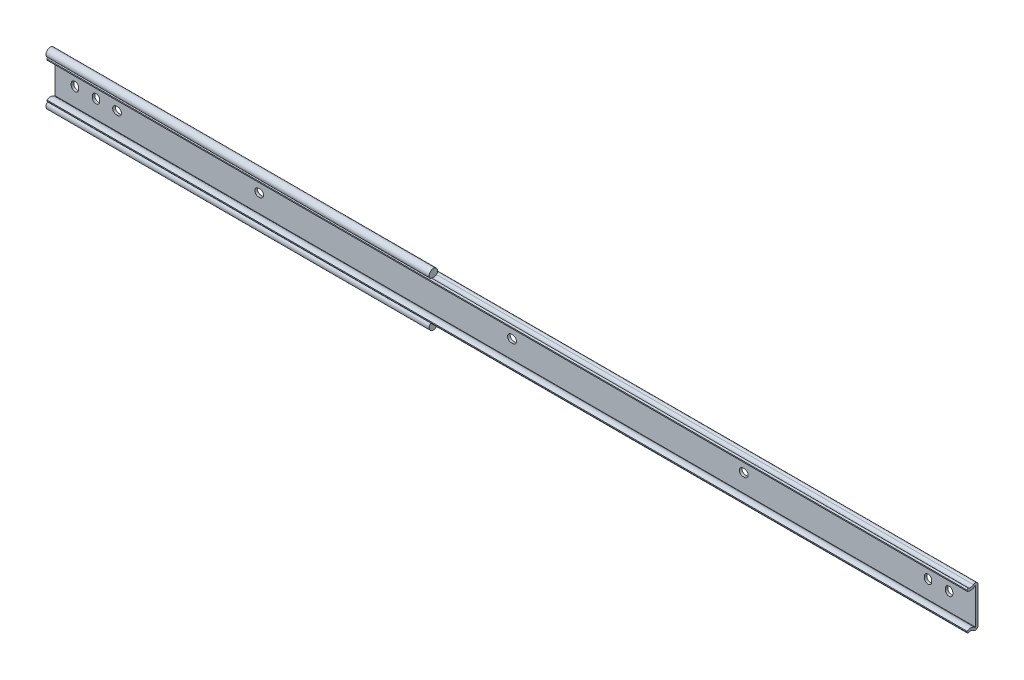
ISO-10303-21;
HEADER;
FILE_DESCRIPTION(('STEP AP214'),'2;1');
FILE_NAME('part.step','',(''),(''),'','','');
FILE_SCHEMA(('AUTOMOTIVE_DESIGN { 1 0 10303 214 1 1 1 1 }'));
ENDSEC;
DATA;
#1=APPLICATION_CONTEXT('core data for automotive mechanical design processes');
#2=APPLICATION_PROTOCOL_DEFINITION('international standard','automotive_design',2000,#1);
#3=PRODUCT_CONTEXT('',#1,'mechanical');
#4=PRODUCT('Part','Part','',(#3));
#5=PRODUCT_RELATED_PRODUCT_CATEGORY('part','',(#4));
#6=PRODUCT_DEFINITION_FORMATION('','',#4);
#7=PRODUCT_DEFINITION_CONTEXT('part definition',#1,'design');
#8=PRODUCT_DEFINITION('design','',#6,#7);
#9=PRODUCT_DEFINITION_SHAPE('','',#8);
#10=(LENGTH_UNIT() NAMED_UNIT(*) SI_UNIT(.MILLI.,.METRE.));
#11=(NAMED_UNIT(*) PLANE_ANGLE_UNIT() SI_UNIT($,.RADIAN.));
#12=(NAMED_UNIT(*) SI_UNIT($,.STERADIAN.) SOLID_ANGLE_UNIT());
#13=UNCERTAINTY_MEASURE_WITH_UNIT(LENGTH_MEASURE(1.E-05),#10,'distance_accuracy_value','');
#14=(GEOMETRIC_REPRESENTATION_CONTEXT(3) GLOBAL_UNCERTAINTY_ASSIGNED_CONTEXT((#13)) GLOBAL_UNIT_ASSIGNED_CONTEXT((#10,
#11,#12)) REPRESENTATION_CONTEXT('',''));
#15=CARTESIAN_POINT('',(0.,0.,0.));
#16=DIRECTION('',(0.,0.,1.));
#17=DIRECTION('',(1.,0.,0.));
#18=AXIS2_PLACEMENT_3D('',#15,#16,#17);
#19=CARTESIAN_POINT('',(-11.9,13.9150000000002,4.44999999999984));
#20=DIRECTION('',(1.,0.,0.));
#21=DIRECTION('',(0.,0.,-1.));
#22=AXIS2_PLACEMENT_3D('',#19,#20,#21);
#23=CYLINDRICAL_SURFACE('',#22,2.55000000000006);
#24=DIRECTION('',(1.,0.,0.));
#25=VECTOR('',#24,1.);
#26=CARTESIAN_POINT('',(-11.9,12.0059666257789,2.75941087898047));
#27=LINE('',#26,#25);
#28=CARTESIAN_POINT('',(219.1,12.0059666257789,2.75941087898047));
#29=VERTEX_POINT('',#28);
#30=CARTESIAN_POINT('',(542.9,12.0059666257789,2.75941087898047));
#31=VERTEX_POINT('',#30);
#32=EDGE_CURVE('E604',#29,#31,#27,.T.);
#33=ORIENTED_EDGE('',*,*,#32,.F.);
#34=CARTESIAN_POINT('',(219.1,13.9150000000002,4.44999999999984));
#35=DIRECTION('',(-1.,0.,0.));
#36=DIRECTION('',(0.,0.,1.));
#37=AXIS2_PLACEMENT_3D('',#34,#35,#36);
#38=CIRCLE('',#37,2.55000000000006);
#39=CARTESIAN_POINT('',(219.1,11.8784795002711,5.98462837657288));
#40=VERTEX_POINT('',#39);
#41=EDGE_CURVE('E357',#29,#40,#38,.T.);
#42=ORIENTED_EDGE('',*,*,#41,.T.);
#43=DIRECTION('',(1.,0.,0.));
#44=VECTOR('',#43,1.);
#45=CARTESIAN_POINT('',(-11.9,11.8784795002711,5.98462837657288));
#46=LINE('',#45,#44);
#47=CARTESIAN_POINT('',(542.9,11.8784795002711,5.98462837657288));
#48=VERTEX_POINT('',#47);
#49=EDGE_CURVE('E603',#40,#48,#46,.T.);
#50=ORIENTED_EDGE('',*,*,#49,.T.);
#51=CARTESIAN_POINT('',(542.9,13.9150000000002,4.44999999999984));
#52=DIRECTION('',(-1.,0.,0.));
#53=DIRECTION('',(0.,0.,1.));
#54=AXIS2_PLACEMENT_3D('',#51,#52,#53);
#55=CIRCLE('',#54,2.55000000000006);
#56=EDGE_CURVE('E531',#31,#48,#55,.T.);
#57=ORIENTED_EDGE('',*,*,#56,.F.);
#58=EDGE_LOOP('',(#33,#42,#50,#57));
#59=FACE_BOUND('',#58,.T.);
#60=ADVANCED_FACE('F14',(#59),#23,.F.);
#61=CARTESIAN_POINT('',(-11.9,-10.7622239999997,0.));
#62=DIRECTION('',(0.,0.,-1.));
#63=DIRECTION('',(-1.,0.,0.));
#64=AXIS2_PLACEMENT_3D('',#61,#62,#63);
#65=PLANE('',#64);
#66=DIRECTION('',(0.,1.,0.));
#67=VECTOR('',#66,1.);
#68=CARTESIAN_POINT('',(-11.9,-10.7622239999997,0.));
#69=LINE('',#68,#67);
#70=CARTESIAN_POINT('',(-11.9,-10.7622239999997,0.));
#71=VERTEX_POINT('',#70);
#72=CARTESIAN_POINT('',(-11.9,10.7622240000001,0.));
#73=VERTEX_POINT('',#72);
#74=EDGE_CURVE('E599',#71,#73,#69,.T.);
#75=ORIENTED_EDGE('',*,*,#74,.T.);
#76=DIRECTION('',(1.,0.,0.));
#77=VECTOR('',#76,1.);
#78=CARTESIAN_POINT('',(-11.9,10.7622240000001,0.));
#79=LINE('',#78,#77);
#80=CARTESIAN_POINT('',(542.9,10.7622240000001,0.));
#81=VERTEX_POINT('',#80);
#82=EDGE_CURVE('E607',#73,#81,#79,.T.);
#83=ORIENTED_EDGE('',*,*,#82,.T.);
#84=DIRECTION('',(0.,1.,0.));
#85=VECTOR('',#84,1.);
#86=CARTESIAN_POINT('',(542.9,-10.7622239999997,0.));
#87=LINE('',#86,#85);
#88=CARTESIAN_POINT('',(542.9,-10.7622239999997,0.));
#89=VERTEX_POINT('',#88);
#90=EDGE_CURVE('E572',#89,#81,#87,.T.);
#91=ORIENTED_EDGE('',*,*,#90,.F.);
#92=DIRECTION('',(1.,0.,0.));
#93=VECTOR('',#92,1.);
#94=CARTESIAN_POINT('',(-11.9,-10.7622239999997,0.));
#95=LINE('',#94,#93);
#96=EDGE_CURVE('E609',#71,#89,#95,.T.);
#97=ORIENTED_EDGE('',*,*,#96,.F.);
#98=EDGE_LOOP('',(#75,#83,#91,#97));
#99=FACE_BOUND('',#98,.T.);
#100=CARTESIAN_POINT('',(403.600000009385,0.00222400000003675,0.));
#101=DIRECTION('',(0.,0.,-1.));
#102=DIRECTION('',(-1.,0.,0.));
#103=AXIS2_PLACEMENT_3D('',#100,#101,#102);
#104=CIRCLE('',#103,2.25);
#105=CARTESIAN_POINT('',(403.600000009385,2.25222400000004,0.));
#106=VERTEX_POINT('',#105);
#107=CARTESIAN_POINT('',(403.600000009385,-2.24777599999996,0.));
#108=VERTEX_POINT('',#107);
#109=EDGE_CURVE('E374',#106,#108,#104,.T.);
#110=ORIENTED_EDGE('',*,*,#109,.F.);
#111=DIRECTION('',(1.,0.,0.));
#112=VECTOR('',#111,1.);
#113=CARTESIAN_POINT('',(402.800000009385,2.25222400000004,0.));
#114=LINE('',#113,#112);
#115=CARTESIAN_POINT('',(402.800000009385,2.25222400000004,0.));
#116=VERTEX_POINT('',#115);
#117=EDGE_CURVE('E382',#116,#106,#114,.T.);
#118=ORIENTED_EDGE('',*,*,#117,.F.);
#119=CARTESIAN_POINT('',(402.800000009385,0.00222400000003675,0.));
#120=DIRECTION('',(0.,0.,-1.));
#121=DIRECTION('',(-1.,0.,0.));
#122=AXIS2_PLACEMENT_3D('',#119,#120,#121);
#123=CIRCLE('',#122,2.25);
#124=CARTESIAN_POINT('',(402.800000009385,-2.24777599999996,0.));
#125=VERTEX_POINT('',#124);
#126=EDGE_CURVE('E379',#125,#116,#123,.T.);
#127=ORIENTED_EDGE('',*,*,#126,.F.);
#128=DIRECTION('',(-1.,0.,0.));
#129=VECTOR('',#128,1.);
#130=CARTESIAN_POINT('',(403.600000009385,-2.24777599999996,0.));
#131=LINE('',#130,#129);
#132=EDGE_CURVE('E376',#108,#125,#131,.T.);
#133=ORIENTED_EDGE('',*,*,#132,.F.);
#134=EDGE_LOOP('',(#110,#118,#127,#133));
#135=FACE_BOUND('',#134,.T.);
#136=CARTESIAN_POINT('',(110.700000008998,0.00273576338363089,0.));
#137=DIRECTION('',(0.,0.,-1.));
#138=DIRECTION('',(-1.,0.,0.));
#139=AXIS2_PLACEMENT_3D('',#136,#137,#138);
#140=CIRCLE('',#139,2.25);
#141=CARTESIAN_POINT('',(110.700000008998,-2.24726423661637,0.));
#142=VERTEX_POINT('',#141);
#143=CARTESIAN_POINT('',(110.700000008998,2.25273576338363,0.));
#144=VERTEX_POINT('',#143);
#145=EDGE_CURVE('E397',#142,#144,#140,.T.);
#146=ORIENTED_EDGE('',*,*,#145,.F.);
#147=DIRECTION('',(-1.,0.,0.));
#148=VECTOR('',#147,1.);
#149=CARTESIAN_POINT('',(111.500000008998,-2.24726423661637,0.));
#150=LINE('',#149,#148);
#151=CARTESIAN_POINT('',(111.500000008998,-2.24726423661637,0.));
#152=VERTEX_POINT('',#151);
#153=EDGE_CURVE('E405',#152,#142,#150,.T.);
#154=ORIENTED_EDGE('',*,*,#153,.F.);
#155=CARTESIAN_POINT('',(111.500000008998,0.00273576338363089,0.));
#156=DIRECTION('',(0.,0.,-1.));
#157=DIRECTION('',(-1.,0.,0.));
#158=AXIS2_PLACEMENT_3D('',#155,#156,#157);
#159=CIRCLE('',#158,2.25);
#160=CARTESIAN_POINT('',(111.500000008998,2.25273576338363,0.));
#161=VERTEX_POINT('',#160);
#162=EDGE_CURVE('E402',#161,#152,#159,.T.);
#163=ORIENTED_EDGE('',*,*,#162,.F.);
#164=DIRECTION('',(1.,0.,0.));
#165=VECTOR('',#164,1.);
#166=CARTESIAN_POINT('',(110.700000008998,2.25273576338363,0.));
#167=LINE('',#166,#165);
#168=EDGE_CURVE('E399',#144,#161,#167,.T.);
#169=ORIENTED_EDGE('',*,*,#168,.F.);
#170=EDGE_LOOP('',(#146,#154,#163,#169));
#171=FACE_BOUND('',#170,.T.);
#172=CARTESIAN_POINT('',(263.100000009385,0.00222400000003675,0.));
#173=DIRECTION('',(0.,0.,-1.));
#174=DIRECTION('',(-1.,0.,0.));
#175=AXIS2_PLACEMENT_3D('',#172,#173,#174);
#176=CIRCLE('',#175,2.25);
#177=CARTESIAN_POINT('',(263.100000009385,-2.24777599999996,0.));
#178=VERTEX_POINT('',#177);
#179=CARTESIAN_POINT('',(263.100000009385,2.25222400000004,0.));
#180=VERTEX_POINT('',#179);
#181=EDGE_CURVE('E411',#178,#180,#176,.T.);
#182=ORIENTED_EDGE('',*,*,#181,.F.);
#183=DIRECTION('',(-1.,0.,0.));
#184=VECTOR('',#183,1.);
#185=CARTESIAN_POINT('',(263.900000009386,-2.24777599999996,0.));
#186=LINE('',#185,#184);
#187=CARTESIAN_POINT('',(263.900000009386,-2.24777599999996,0.));
#188=VERTEX_POINT('',#187);
#189=EDGE_CURVE('E425',#188,#178,#186,.T.);
#190=ORIENTED_EDGE('',*,*,#189,.F.);
#191=CARTESIAN_POINT('',(263.900000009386,0.00222400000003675,0.));
#192=DIRECTION('',(0.,0.,-1.));
#193=DIRECTION('',(-1.,0.,0.));
#194=AXIS2_PLACEMENT_3D('',#191,#192,#193);
#195=CIRCLE('',#194,2.25);
#196=CARTESIAN_POINT('',(263.900000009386,2.25222400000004,0.));
#197=VERTEX_POINT('',#196);
#198=EDGE_CURVE('E422',#197,#188,#195,.T.);
#199=ORIENTED_EDGE('',*,*,#198,.F.);
#200=DIRECTION('',(1.,0.,0.));
#201=VECTOR('',#200,1.);
#202=CARTESIAN_POINT('',(263.100000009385,2.25222400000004,0.));
#203=LINE('',#202,#201);
#204=EDGE_CURVE('E419',#180,#197,#203,.T.);
#205=ORIENTED_EDGE('',*,*,#204,.F.);
#206=EDGE_LOOP('',(#182,#190,#199,#205));
#207=FACE_BOUND('',#206,.T.);
#208=CARTESIAN_POINT('',(25.000000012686,0.00356750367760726,0.));
#209=DIRECTION('',(0.,0.,-1.));
#210=DIRECTION('',(-1.,0.,0.));
#211=AXIS2_PLACEMENT_3D('',#208,#209,#210);
#212=CIRCLE('',#211,2.25);
#213=CARTESIAN_POINT('',(25.000000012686,-2.24643249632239,0.));
#214=VERTEX_POINT('',#213);
#215=CARTESIAN_POINT('',(25.000000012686,2.2535675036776,0.));
#216=VERTEX_POINT('',#215);
#217=EDGE_CURVE('E431',#214,#216,#212,.T.);
#218=ORIENTED_EDGE('',*,*,#217,.F.);
#219=DIRECTION('',(-1.,0.,0.));
#220=VECTOR('',#219,1.);
#221=CARTESIAN_POINT('',(25.800000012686,-2.24643249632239,0.));
#222=LINE('',#221,#220);
#223=CARTESIAN_POINT('',(25.800000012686,-2.24643249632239,0.));
#224=VERTEX_POINT('',#223);
#225=EDGE_CURVE('E445',#224,#214,#222,.T.);
#226=ORIENTED_EDGE('',*,*,#225,.F.);
#227=CARTESIAN_POINT('',(25.800000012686,0.00356750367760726,0.));
#228=DIRECTION('',(0.,0.,-1.));
#229=DIRECTION('',(-1.,0.,0.));
#230=AXIS2_PLACEMENT_3D('',#227,#228,#229);
#231=CIRCLE('',#230,2.25);
#232=CARTESIAN_POINT('',(25.800000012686,2.2535675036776,0.));
#233=VERTEX_POINT('',#232);
#234=EDGE_CURVE('E442',#233,#224,#231,.T.);
#235=ORIENTED_EDGE('',*,*,#234,.F.);
#236=DIRECTION('',(1.,0.,0.));
#237=VECTOR('',#236,1.);
#238=CARTESIAN_POINT('',(25.000000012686,2.2535675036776,0.));
#239=LINE('',#238,#237);
#240=EDGE_CURVE('E439',#216,#233,#239,.T.);
#241=ORIENTED_EDGE('',*,*,#240,.F.);
#242=EDGE_LOOP('',(#218,#226,#235,#241));
#243=FACE_BOUND('',#242,.T.);
#244=CARTESIAN_POINT('',(0.,-0.400000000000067,0.));
#245=DIRECTION('',(0.,0.,-1.));
#246=DIRECTION('',(1.,0.,0.));
#247=AXIS2_PLACEMENT_3D('',#244,#245,#246);
#248=CIRCLE('',#247,2.24999999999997);
#249=CARTESIAN_POINT('',(2.25000000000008,-0.400000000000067,0.));
#250=VERTEX_POINT('',#249);
#251=CARTESIAN_POINT('',(-2.24999999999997,-0.400000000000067,0.));
#252=VERTEX_POINT('',#251);
#253=EDGE_CURVE('E451',#250,#252,#248,.T.);
#254=ORIENTED_EDGE('',*,*,#253,.F.);
#255=DIRECTION('',(0.,-1.,0.));
#256=VECTOR('',#255,1.);
#257=CARTESIAN_POINT('',(2.25000000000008,-0.400000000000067,0.));
#258=LINE('',#257,#256);
#259=CARTESIAN_POINT('',(2.25000000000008,0.400000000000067,0.));
#260=VERTEX_POINT('',#259);
#261=EDGE_CURVE('E465',#260,#250,#258,.T.);
#262=ORIENTED_EDGE('',*,*,#261,.F.);
#263=CARTESIAN_POINT('',(0.,0.400000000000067,0.));
#264=DIRECTION('',(0.,0.,-1.));
#265=DIRECTION('',(1.,0.,0.));
#266=AXIS2_PLACEMENT_3D('',#263,#264,#265);
#267=CIRCLE('',#266,2.24999999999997);
#268=CARTESIAN_POINT('',(-2.24999999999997,0.400000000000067,0.));
#269=VERTEX_POINT('',#268);
#270=EDGE_CURVE('E462',#269,#260,#267,.T.);
#271=ORIENTED_EDGE('',*,*,#270,.F.);
#272=DIRECTION('',(0.,1.,0.));
#273=VECTOR('',#272,1.);
#274=CARTESIAN_POINT('',(-2.24999999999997,-0.400000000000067,0.));
#275=LINE('',#274,#273);
#276=EDGE_CURVE('E459',#252,#269,#275,.T.);
#277=ORIENTED_EDGE('',*,*,#276,.F.);
#278=EDGE_LOOP('',(#254,#262,#271,#277));
#279=FACE_BOUND('',#278,.T.);
#280=CARTESIAN_POINT('',(12.7,-0.400000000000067,0.));
#281=DIRECTION('',(0.,0.,-1.));
#282=DIRECTION('',(1.,0.,0.));
#283=AXIS2_PLACEMENT_3D('',#280,#281,#282);
#284=CIRCLE('',#283,2.24999999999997);
#285=CARTESIAN_POINT('',(14.95,-0.400000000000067,0.));
#286=VERTEX_POINT('',#285);
#287=CARTESIAN_POINT('',(10.45,-0.400000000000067,0.));
#288=VERTEX_POINT('',#287);
#289=EDGE_CURVE('E471',#286,#288,#284,.T.);
#290=ORIENTED_EDGE('',*,*,#289,.F.);
#291=DIRECTION('',(0.,-1.,0.));
#292=VECTOR('',#291,1.);
#293=CARTESIAN_POINT('',(14.95,-0.400000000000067,0.));
#294=LINE('',#293,#292);
#295=CARTESIAN_POINT('',(14.95,0.400000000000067,0.));
#296=VERTEX_POINT('',#295);
#297=EDGE_CURVE('E485',#296,#286,#294,.T.);
#298=ORIENTED_EDGE('',*,*,#297,.F.);
#299=CARTESIAN_POINT('',(12.7,0.400000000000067,0.));
#300=DIRECTION('',(0.,0.,-1.));
#301=DIRECTION('',(1.,0.,0.));
#302=AXIS2_PLACEMENT_3D('',#299,#300,#301);
#303=CIRCLE('',#302,2.24999999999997);
#304=CARTESIAN_POINT('',(10.45,0.400000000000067,0.));
#305=VERTEX_POINT('',#304);
#306=EDGE_CURVE('E482',#305,#296,#303,.T.);
#307=ORIENTED_EDGE('',*,*,#306,.F.);
#308=DIRECTION('',(0.,1.,0.));
#309=VECTOR('',#308,1.);
#310=CARTESIAN_POINT('',(10.45,-0.400000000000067,0.));
#311=LINE('',#310,#309);
#312=EDGE_CURVE('E479',#288,#305,#311,.T.);
#313=ORIENTED_EDGE('',*,*,#312,.F.);
#314=EDGE_LOOP('',(#290,#298,#307,#313));
#315=FACE_BOUND('',#314,.T.);
#316=CARTESIAN_POINT('',(514.3,-0.400000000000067,0.));
#317=DIRECTION('',(0.,0.,-1.));
#318=DIRECTION('',(1.,0.,0.));
#319=AXIS2_PLACEMENT_3D('',#316,#317,#318);
#320=CIRCLE('',#319,2.24999999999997);
#321=CARTESIAN_POINT('',(516.55,-0.400000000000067,0.));
#322=VERTEX_POINT('',#321);
#323=CARTESIAN_POINT('',(512.05,-0.400000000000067,0.));
#324=VERTEX_POINT('',#323);
#325=EDGE_CURVE('E491',#322,#324,#320,.T.);
#326=ORIENTED_EDGE('',*,*,#325,.F.);
#327=DIRECTION('',(0.,-1.,0.));
#328=VECTOR('',#327,1.);
#329=CARTESIAN_POINT('',(516.55,-0.400000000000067,0.));
#330=LINE('',#329,#328);
#331=CARTESIAN_POINT('',(516.55,0.400000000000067,0.));
#332=VERTEX_POINT('',#331);
#333=EDGE_CURVE('E505',#332,#322,#330,.T.);
#334=ORIENTED_EDGE('',*,*,#333,.F.);
#335=CARTESIAN_POINT('',(514.3,0.400000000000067,0.));
#336=DIRECTION('',(0.,0.,-1.));
#337=DIRECTION('',(1.,0.,0.));
#338=AXIS2_PLACEMENT_3D('',#335,#336,#337);
#339=CIRCLE('',#338,2.24999999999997);
#340=CARTESIAN_POINT('',(512.05,0.400000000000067,0.));
#341=VERTEX_POINT('',#340);
#342=EDGE_CURVE('E502',#341,#332,#339,.T.);
#343=ORIENTED_EDGE('',*,*,#342,.F.);
#344=DIRECTION('',(0.,1.,0.));
#345=VECTOR('',#344,1.);
#346=CARTESIAN_POINT('',(512.05,-0.400000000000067,0.));
#347=LINE('',#346,#345);
#348=EDGE_CURVE('E499',#324,#341,#347,.T.);
#349=ORIENTED_EDGE('',*,*,#348,.F.);
#350=EDGE_LOOP('',(#326,#334,#343,#349));
#351=FACE_BOUND('',#350,.T.);
#352=CARTESIAN_POINT('',(527.,-0.400000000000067,0.));
#353=DIRECTION('',(0.,0.,-1.));
#354=DIRECTION('',(1.,0.,0.));
#355=AXIS2_PLACEMENT_3D('',#352,#353,#354);
#356=CIRCLE('',#355,2.24999999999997);
#357=CARTESIAN_POINT('',(529.25,-0.400000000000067,0.));
#358=VERTEX_POINT('',#357);
#359=CARTESIAN_POINT('',(524.75,-0.400000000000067,0.));
#360=VERTEX_POINT('',#359);
#361=EDGE_CURVE('E511',#358,#360,#356,.T.);
#362=ORIENTED_EDGE('',*,*,#361,.F.);
#363=DIRECTION('',(0.,-1.,0.));
#364=VECTOR('',#363,1.);
#365=CARTESIAN_POINT('',(529.25,-0.400000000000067,0.));
#366=LINE('',#365,#364);
#367=CARTESIAN_POINT('',(529.25,0.400000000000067,0.));
#368=VERTEX_POINT('',#367);
#369=EDGE_CURVE('E525',#368,#358,#366,.T.);
#370=ORIENTED_EDGE('',*,*,#369,.F.);
#371=CARTESIAN_POINT('',(527.,0.400000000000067,0.));
#372=DIRECTION('',(0.,0.,-1.));
#373=DIRECTION('',(1.,0.,0.));
#374=AXIS2_PLACEMENT_3D('',#371,#372,#373);
#375=CIRCLE('',#374,2.24999999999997);
#376=CARTESIAN_POINT('',(524.75,0.400000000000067,0.));
#377=VERTEX_POINT('',#376);
#378=EDGE_CURVE('E522',#377,#368,#375,.T.);
#379=ORIENTED_EDGE('',*,*,#378,.F.);
#380=DIRECTION('',(0.,1.,0.));
#381=VECTOR('',#380,1.);
#382=CARTESIAN_POINT('',(524.75,-0.400000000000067,0.));
#383=LINE('',#382,#381);
#384=EDGE_CURVE('E519',#360,#377,#383,.T.);
#385=ORIENTED_EDGE('',*,*,#384,.F.);
#386=EDGE_LOOP('',(#362,#370,#379,#385));
#387=FACE_BOUND('',#386,.T.);
#388=ADVANCED_FACE('F722',(#99,#135,#171,#207,#243,#279,#315,#351,#387),#65,.T.);
#389=CARTESIAN_POINT('',(-11.9,10.7622240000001,1.54999999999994));
#390=DIRECTION('',(0.,0.,1.));
#391=DIRECTION('',(1.,0.,0.));
#392=AXIS2_PLACEMENT_3D('',#389,#390,#391);
#393=PLANE('',#392);
#394=DIRECTION('',(0.,-1.,0.));
#395=VECTOR('',#394,1.);
#396=CARTESIAN_POINT('',(-11.9,10.7622240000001,1.54999999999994));
#397=LINE('',#396,#395);
#398=CARTESIAN_POINT('',(-11.9,10.7622240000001,1.54999999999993));
#399=VERTEX_POINT('',#398);
#400=CARTESIAN_POINT('',(-11.9,-10.7622239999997,1.54999999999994));
#401=VERTEX_POINT('',#400);
#402=EDGE_CURVE('E584',#399,#401,#397,.T.);
#403=ORIENTED_EDGE('',*,*,#402,.T.);
#404=DIRECTION('',(1.,0.,0.));
#405=VECTOR('',#404,1.);
#406=CARTESIAN_POINT('',(-11.9,-10.7622239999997,1.54999999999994));
#407=LINE('',#406,#405);
#408=CARTESIAN_POINT('',(542.9,-10.7622239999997,1.54999999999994));
#409=VERTEX_POINT('',#408);
#410=EDGE_CURVE('E622',#401,#409,#407,.T.);
#411=ORIENTED_EDGE('',*,*,#410,.T.);
#412=DIRECTION('',(0.,-1.,0.));
#413=VECTOR('',#412,1.);
#414=CARTESIAN_POINT('',(542.9,10.7622240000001,1.54999999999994));
#415=LINE('',#414,#413);
#416=CARTESIAN_POINT('',(542.9,10.7622240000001,1.54999999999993));
#417=VERTEX_POINT('',#416);
#418=EDGE_CURVE('E552',#417,#409,#415,.T.);
#419=ORIENTED_EDGE('',*,*,#418,.F.);
#420=DIRECTION('',(1.,0.,0.));
#421=VECTOR('',#420,1.);
#422=CARTESIAN_POINT('',(-11.9,10.7622240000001,1.54999999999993));
#423=LINE('',#422,#421);
#424=EDGE_CURVE('E624',#399,#417,#423,.T.);
#425=ORIENTED_EDGE('',*,*,#424,.F.);
#426=EDGE_LOOP('',(#403,#411,#419,#425));
#427=FACE_BOUND('',#426,.T.);
#428=CARTESIAN_POINT('',(403.600000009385,0.00222400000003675,1.54999999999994));
#429=DIRECTION('',(0.,0.,1.));
#430=DIRECTION('',(1.,0.,0.));
#431=AXIS2_PLACEMENT_3D('',#428,#429,#430);
#432=CIRCLE('',#431,2.25);
#433=CARTESIAN_POINT('',(403.600000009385,2.25222400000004,1.54999999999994));
#434=VERTEX_POINT('',#433);
#435=CARTESIAN_POINT('',(403.600000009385,-2.24777599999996,1.54999999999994));
#436=VERTEX_POINT('',#435);
#437=EDGE_CURVE('E371',#434,#436,#432,.F.);
#438=ORIENTED_EDGE('',*,*,#437,.T.);
#439=DIRECTION('',(-1.,0.,0.));
#440=VECTOR('',#439,1.);
#441=CARTESIAN_POINT('',(403.600000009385,-2.24777599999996,1.54999999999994));
#442=LINE('',#441,#440);
#443=CARTESIAN_POINT('',(402.800000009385,-2.24777599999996,1.54999999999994));
#444=VERTEX_POINT('',#443);
#445=EDGE_CURVE('E388',#436,#444,#442,.T.);
#446=ORIENTED_EDGE('',*,*,#445,.T.);
#447=CARTESIAN_POINT('',(402.800000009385,0.00222400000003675,1.54999999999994));
#448=DIRECTION('',(0.,0.,1.));
#449=DIRECTION('',(1.,0.,0.));
#450=AXIS2_PLACEMENT_3D('',#447,#448,#449);
#451=CIRCLE('',#450,2.25);
#452=CARTESIAN_POINT('',(402.800000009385,2.25222400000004,1.54999999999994));
#453=VERTEX_POINT('',#452);
#454=EDGE_CURVE('E365',#444,#453,#451,.F.);
#455=ORIENTED_EDGE('',*,*,#454,.T.);
#456=DIRECTION('',(1.,0.,0.));
#457=VECTOR('',#456,1.);
#458=CARTESIAN_POINT('',(402.800000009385,2.25222400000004,1.54999999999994));
#459=LINE('',#458,#457);
#460=EDGE_CURVE('E368',#453,#434,#459,.T.);
#461=ORIENTED_EDGE('',*,*,#460,.T.);
#462=EDGE_LOOP('',(#438,#446,#455,#461));
#463=FACE_BOUND('',#462,.T.);
#464=CARTESIAN_POINT('',(110.700000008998,0.00273576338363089,1.54999999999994));
#465=DIRECTION('',(0.,0.,1.));
#466=DIRECTION('',(1.,0.,0.));
#467=AXIS2_PLACEMENT_3D('',#464,#465,#466);
#468=CIRCLE('',#467,2.25);
#469=CARTESIAN_POINT('',(110.700000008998,2.25273576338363,1.54999999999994));
#470=VERTEX_POINT('',#469);
#471=CARTESIAN_POINT('',(110.700000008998,-2.24726423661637,1.54999999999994));
#472=VERTEX_POINT('',#471);
#473=EDGE_CURVE('E693',#470,#472,#468,.T.);
#474=ORIENTED_EDGE('',*,*,#473,.F.);
#475=DIRECTION('',(-1.,0.,0.));
#476=VECTOR('',#475,1.);
#477=CARTESIAN_POINT('',(-11.9,2.25273576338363,1.54999999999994));
#478=LINE('',#477,#476);
#479=CARTESIAN_POINT('',(111.500000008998,2.25273576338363,1.54999999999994));
#480=VERTEX_POINT('',#479);
#481=EDGE_CURVE('E686',#480,#470,#478,.T.);
#482=ORIENTED_EDGE('',*,*,#481,.F.);
#483=CARTESIAN_POINT('',(111.500000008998,0.00273576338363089,1.54999999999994));
#484=DIRECTION('',(0.,0.,1.));
#485=DIRECTION('',(1.,0.,0.));
#486=AXIS2_PLACEMENT_3D('',#483,#484,#485);
#487=CIRCLE('',#486,2.25);
#488=CARTESIAN_POINT('',(111.500000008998,-2.24726423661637,1.54999999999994));
#489=VERTEX_POINT('',#488);
#490=EDGE_CURVE('E688',#489,#480,#487,.T.);
#491=ORIENTED_EDGE('',*,*,#490,.F.);
#492=DIRECTION('',(1.,0.,0.));
#493=VECTOR('',#492,1.);
#494=CARTESIAN_POINT('',(-11.9,-2.24726423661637,1.54999999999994));
#495=LINE('',#494,#493);
#496=EDGE_CURVE('E691',#472,#489,#495,.T.);
#497=ORIENTED_EDGE('',*,*,#496,.F.);
#498=EDGE_LOOP('',(#474,#482,#491,#497));
#499=FACE_BOUND('',#498,.T.);
#500=CARTESIAN_POINT('',(263.100000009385,0.00222400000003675,1.54999999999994));
#501=DIRECTION('',(0.,0.,1.));
#502=DIRECTION('',(1.,0.,0.));
#503=AXIS2_PLACEMENT_3D('',#500,#501,#502);
#504=CIRCLE('',#503,2.25);
#505=CARTESIAN_POINT('',(263.100000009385,2.25222400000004,1.54999999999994));
#506=VERTEX_POINT('',#505);
#507=CARTESIAN_POINT('',(263.100000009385,-2.24777599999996,1.54999999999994));
#508=VERTEX_POINT('',#507);
#509=EDGE_CURVE('E684',#506,#508,#504,.T.);
#510=ORIENTED_EDGE('',*,*,#509,.F.);
#511=DIRECTION('',(-1.,0.,0.));
#512=VECTOR('',#511,1.);
#513=CARTESIAN_POINT('',(-11.9,2.25222400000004,1.54999999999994));
#514=LINE('',#513,#512);
#515=CARTESIAN_POINT('',(263.900000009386,2.25222400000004,1.54999999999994));
#516=VERTEX_POINT('',#515);
#517=EDGE_CURVE('E677',#516,#506,#514,.T.);
#518=ORIENTED_EDGE('',*,*,#517,.F.);
#519=CARTESIAN_POINT('',(263.900000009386,0.00222400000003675,1.54999999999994));
#520=DIRECTION('',(0.,0.,1.));
#521=DIRECTION('',(1.,0.,0.));
#522=AXIS2_PLACEMENT_3D('',#519,#520,#521);
#523=CIRCLE('',#522,2.25);
#524=CARTESIAN_POINT('',(263.900000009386,-2.24777599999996,1.54999999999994));
#525=VERTEX_POINT('',#524);
#526=EDGE_CURVE('E679',#525,#516,#523,.T.);
#527=ORIENTED_EDGE('',*,*,#526,.F.);
#528=DIRECTION('',(1.,0.,0.));
#529=VECTOR('',#528,1.);
#530=CARTESIAN_POINT('',(-11.9,-2.24777599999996,1.54999999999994));
#531=LINE('',#530,#529);
#532=EDGE_CURVE('E682',#508,#525,#531,.T.);
#533=ORIENTED_EDGE('',*,*,#532,.F.);
#534=EDGE_LOOP('',(#510,#518,#527,#533));
#535=FACE_BOUND('',#534,.T.);
#536=CARTESIAN_POINT('',(25.000000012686,0.00356750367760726,1.54999999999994));
#537=DIRECTION('',(0.,0.,1.));
#538=DIRECTION('',(1.,0.,0.));
#539=AXIS2_PLACEMENT_3D('',#536,#537,#538);
#540=CIRCLE('',#539,2.25);
#541=CARTESIAN_POINT('',(25.000000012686,2.2535675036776,1.54999999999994));
#542=VERTEX_POINT('',#541);
#543=CARTESIAN_POINT('',(25.000000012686,-2.24643249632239,1.54999999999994));
#544=VERTEX_POINT('',#543);
#545=EDGE_CURVE('E675',#542,#544,#540,.T.);
#546=ORIENTED_EDGE('',*,*,#545,.F.);
#547=DIRECTION('',(-1.,0.,0.));
#548=VECTOR('',#547,1.);
#549=CARTESIAN_POINT('',(-11.9,2.2535675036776,1.54999999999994));
#550=LINE('',#549,#548);
#551=CARTESIAN_POINT('',(25.800000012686,2.2535675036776,1.54999999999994));
#552=VERTEX_POINT('',#551);
#553=EDGE_CURVE('E668',#552,#542,#550,.T.);
#554=ORIENTED_EDGE('',*,*,#553,.F.);
#555=CARTESIAN_POINT('',(25.800000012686,0.00356750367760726,1.54999999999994));
#556=DIRECTION('',(0.,0.,1.));
#557=DIRECTION('',(1.,0.,0.));
#558=AXIS2_PLACEMENT_3D('',#555,#556,#557);
#559=CIRCLE('',#558,2.25);
#560=CARTESIAN_POINT('',(25.800000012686,-2.24643249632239,1.54999999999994));
#561=VERTEX_POINT('',#560);
#562=EDGE_CURVE('E670',#561,#552,#559,.T.);
#563=ORIENTED_EDGE('',*,*,#562,.F.);
#564=DIRECTION('',(1.,0.,0.));
#565=VECTOR('',#564,1.);
#566=CARTESIAN_POINT('',(-11.9,-2.24643249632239,1.54999999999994));
#567=LINE('',#566,#565);
#568=EDGE_CURVE('E673',#544,#561,#567,.T.);
#569=ORIENTED_EDGE('',*,*,#568,.F.);
#570=EDGE_LOOP('',(#546,#554,#563,#569));
#571=FACE_BOUND('',#570,.T.);
#572=CARTESIAN_POINT('',(0.,-0.400000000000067,1.54999999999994));
#573=DIRECTION('',(0.,0.,1.));
#574=DIRECTION('',(1.,0.,0.));
#575=AXIS2_PLACEMENT_3D('',#572,#573,#574);
#576=CIRCLE('',#575,2.24999999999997);
#577=CARTESIAN_POINT('',(-2.24999999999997,-0.400000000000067,1.54999999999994));
#578=VERTEX_POINT('',#577);
#579=CARTESIAN_POINT('',(2.25000000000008,-0.400000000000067,1.54999999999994));
#580=VERTEX_POINT('',#579);
#581=EDGE_CURVE('E666',#578,#580,#576,.T.);
#582=ORIENTED_EDGE('',*,*,#581,.F.);
#583=DIRECTION('',(0.,-1.,0.));
#584=VECTOR('',#583,1.);
#585=CARTESIAN_POINT('',(-2.24999999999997,10.7622240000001,1.54999999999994));
#586=LINE('',#585,#584);
#587=CARTESIAN_POINT('',(-2.24999999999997,0.400000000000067,1.54999999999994));
#588=VERTEX_POINT('',#587);
#589=EDGE_CURVE('E659',#588,#578,#586,.T.);
#590=ORIENTED_EDGE('',*,*,#589,.F.);
#591=CARTESIAN_POINT('',(0.,0.400000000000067,1.54999999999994));
#592=DIRECTION('',(0.,0.,1.));
#593=DIRECTION('',(1.,0.,0.));
#594=AXIS2_PLACEMENT_3D('',#591,#592,#593);
#595=CIRCLE('',#594,2.24999999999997);
#596=CARTESIAN_POINT('',(2.25000000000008,0.400000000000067,1.54999999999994));
#597=VERTEX_POINT('',#596);
#598=EDGE_CURVE('E661',#597,#588,#595,.T.);
#599=ORIENTED_EDGE('',*,*,#598,.F.);
#600=DIRECTION('',(0.,1.,0.));
#601=VECTOR('',#600,1.);
#602=CARTESIAN_POINT('',(2.25000000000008,10.7622240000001,1.54999999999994));
#603=LINE('',#602,#601);
#604=EDGE_CURVE('E664',#580,#597,#603,.T.);
#605=ORIENTED_EDGE('',*,*,#604,.F.);
#606=EDGE_LOOP('',(#582,#590,#599,#605));
#607=FACE_BOUND('',#606,.T.);
#608=CARTESIAN_POINT('',(12.7,-0.400000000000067,1.54999999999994));
#609=DIRECTION('',(0.,0.,1.));
#610=DIRECTION('',(1.,0.,0.));
#611=AXIS2_PLACEMENT_3D('',#608,#609,#610);
#612=CIRCLE('',#611,2.24999999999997);
#613=CARTESIAN_POINT('',(10.45,-0.400000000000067,1.54999999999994));
#614=VERTEX_POINT('',#613);
#615=CARTESIAN_POINT('',(14.95,-0.400000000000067,1.54999999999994));
#616=VERTEX_POINT('',#615);
#617=EDGE_CURVE('E657',#614,#616,#612,.T.);
#618=ORIENTED_EDGE('',*,*,#617,.F.);
#619=DIRECTION('',(0.,-1.,0.));
#620=VECTOR('',#619,1.);
#621=CARTESIAN_POINT('',(10.45,10.7622240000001,1.54999999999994));
#622=LINE('',#621,#620);
#623=CARTESIAN_POINT('',(10.45,0.400000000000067,1.54999999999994));
#624=VERTEX_POINT('',#623);
#625=EDGE_CURVE('E650',#624,#614,#622,.T.);
#626=ORIENTED_EDGE('',*,*,#625,.F.);
#627=CARTESIAN_POINT('',(12.7,0.400000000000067,1.54999999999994));
#628=DIRECTION('',(0.,0.,1.));
#629=DIRECTION('',(1.,0.,0.));
#630=AXIS2_PLACEMENT_3D('',#627,#628,#629);
#631=CIRCLE('',#630,2.24999999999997);
#632=CARTESIAN_POINT('',(14.95,0.400000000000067,1.54999999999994));
#633=VERTEX_POINT('',#632);
#634=EDGE_CURVE('E652',#633,#624,#631,.T.);
#635=ORIENTED_EDGE('',*,*,#634,.F.);
#636=DIRECTION('',(0.,1.,0.));
#637=VECTOR('',#636,1.);
#638=CARTESIAN_POINT('',(14.95,10.7622240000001,1.54999999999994));
#639=LINE('',#638,#637);
#640=EDGE_CURVE('E655',#616,#633,#639,.T.);
#641=ORIENTED_EDGE('',*,*,#640,.F.);
#642=EDGE_LOOP('',(#618,#626,#635,#641));
#643=FACE_BOUND('',#642,.T.);
#644=CARTESIAN_POINT('',(514.3,-0.400000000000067,1.54999999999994));
#645=DIRECTION('',(0.,0.,1.));
#646=DIRECTION('',(1.,0.,0.));
#647=AXIS2_PLACEMENT_3D('',#644,#645,#646);
#648=CIRCLE('',#647,2.24999999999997);
#649=CARTESIAN_POINT('',(512.05,-0.400000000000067,1.54999999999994));
#650=VERTEX_POINT('',#649);
#651=CARTESIAN_POINT('',(516.55,-0.400000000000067,1.54999999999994));
#652=VERTEX_POINT('',#651);
#653=EDGE_CURVE('E648',#650,#652,#648,.T.);
#654=ORIENTED_EDGE('',*,*,#653,.F.);
#655=DIRECTION('',(0.,-1.,0.));
#656=VECTOR('',#655,1.);
#657=CARTESIAN_POINT('',(512.05,10.7622240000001,1.54999999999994));
#658=LINE('',#657,#656);
#659=CARTESIAN_POINT('',(512.05,0.400000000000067,1.54999999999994));
#660=VERTEX_POINT('',#659);
#661=EDGE_CURVE('E641',#660,#650,#658,.T.);
#662=ORIENTED_EDGE('',*,*,#661,.F.);
#663=CARTESIAN_POINT('',(514.3,0.400000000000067,1.54999999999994));
#664=DIRECTION('',(0.,0.,1.));
#665=DIRECTION('',(1.,0.,0.));
#666=AXIS2_PLACEMENT_3D('',#663,#664,#665);
#667=CIRCLE('',#666,2.24999999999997);
#668=CARTESIAN_POINT('',(516.55,0.400000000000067,1.54999999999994));
#669=VERTEX_POINT('',#668);
#670=EDGE_CURVE('E643',#669,#660,#667,.T.);
#671=ORIENTED_EDGE('',*,*,#670,.F.);
#672=DIRECTION('',(0.,1.,0.));
#673=VECTOR('',#672,1.);
#674=CARTESIAN_POINT('',(516.55,10.7622240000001,1.54999999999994));
#675=LINE('',#674,#673);
#676=EDGE_CURVE('E646',#652,#669,#675,.T.);
#677=ORIENTED_EDGE('',*,*,#676,.F.);
#678=EDGE_LOOP('',(#654,#662,#671,#677));
#679=FACE_BOUND('',#678,.T.);
#680=CARTESIAN_POINT('',(527.,-0.400000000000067,1.54999999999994));
#681=DIRECTION('',(0.,0.,1.));
#682=DIRECTION('',(1.,0.,0.));
#683=AXIS2_PLACEMENT_3D('',#680,#681,#682);
#684=CIRCLE('',#683,2.24999999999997);
#685=CARTESIAN_POINT('',(524.75,-0.400000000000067,1.54999999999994));
#686=VERTEX_POINT('',#685);
#687=CARTESIAN_POINT('',(529.25,-0.400000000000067,1.54999999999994));
#688=VERTEX_POINT('',#687);
#689=EDGE_CURVE('E639',#686,#688,#684,.T.);
#690=ORIENTED_EDGE('',*,*,#689,.F.);
#691=DIRECTION('',(0.,-1.,0.));
#692=VECTOR('',#691,1.);
#693=CARTESIAN_POINT('',(524.75,10.7622240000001,1.54999999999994));
#694=LINE('',#693,#692);
#695=CARTESIAN_POINT('',(524.75,0.400000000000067,1.54999999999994));
#696=VERTEX_POINT('',#695);
#697=EDGE_CURVE('E606',#696,#686,#694,.T.);
#698=ORIENTED_EDGE('',*,*,#697,.F.);
#699=CARTESIAN_POINT('',(527.,0.400000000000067,1.54999999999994));
#700=DIRECTION('',(0.,0.,1.));
#701=DIRECTION('',(1.,0.,0.));
#702=AXIS2_PLACEMENT_3D('',#699,#700,#701);
#703=CIRCLE('',#702,2.24999999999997);
#704=CARTESIAN_POINT('',(529.25,0.400000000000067,1.54999999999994));
#705=VERTEX_POINT('',#704);
#706=EDGE_CURVE('E634',#705,#696,#703,.T.);
#707=ORIENTED_EDGE('',*,*,#706,.F.);
#708=DIRECTION('',(0.,1.,0.));
#709=VECTOR('',#708,1.);
#710=CARTESIAN_POINT('',(529.25,10.7622240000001,1.54999999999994));
#711=LINE('',#710,#709);
#712=EDGE_CURVE('E637',#688,#705,#711,.T.);
#713=ORIENTED_EDGE('',*,*,#712,.F.);
#714=EDGE_LOOP('',(#690,#698,#707,#713));
#715=FACE_BOUND('',#714,.T.);
#716=ADVANCED_FACE('F753',(#427,#463,#499,#535,#571,#607,#643,#679,#715),#393,.T.);
#717=CARTESIAN_POINT('',(-11.9,13.9150000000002,4.44999999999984));
#718=DIRECTION('',(-1.,0.,0.));
#719=DIRECTION('',(0.,0.,1.));
#720=AXIS2_PLACEMENT_3D('',#717,#718,#719);
#721=PLANE('',#720);
#722=CARTESIAN_POINT('',(-11.9,-10.7622239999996,1.66));
#723=DIRECTION('',(1.,0.,0.));
#724=DIRECTION('',(0.,0.,1.));
#725=AXIS2_PLACEMENT_3D('',#722,#723,#724);
#726=CIRCLE('',#725,1.66);
#727=CARTESIAN_POINT('',(-11.9,-12.2669175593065,2.36106867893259));
#728=VERTEX_POINT('',#727);
#729=EDGE_CURVE('E597',#728,#71,#726,.T.);
#730=ORIENTED_EDGE('',*,*,#729,.F.);
#731=CARTESIAN_POINT('',(-11.9,-13.5749999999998,4.55));
#732=DIRECTION('',(-1.,0.,0.));
#733=DIRECTION('',(0.,0.,-1.));
#734=AXIS2_PLACEMENT_3D('',#731,#732,#733);
#735=CIRCLE('',#734,2.55);
#736=CARTESIAN_POINT('',(-11.9,-11.6159967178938,6.18242339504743));
#737=VERTEX_POINT('',#736);
#738=EDGE_CURVE('E709',#728,#737,#735,.T.);
#739=ORIENTED_EDGE('',*,*,#738,.T.);
#740=DIRECTION('',(0.,-0.798635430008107,-0.60181512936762));
#741=VECTOR('',#740,1.);
#742=CARTESIAN_POINT('',(-11.9,-11.8784795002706,5.98462837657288));
#743=LINE('',#742,#741);
#744=CARTESIAN_POINT('',(-11.9,-11.0618539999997,6.6));
#745=VERTEX_POINT('',#744);
#746=EDGE_CURVE('E595',#745,#737,#743,.T.);
#747=ORIENTED_EDGE('',*,*,#746,.F.);
#748=DIRECTION('',(0.,-1.,0.));
#749=VECTOR('',#748,1.);
#750=CARTESIAN_POINT('',(-11.9,-11.0618539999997,6.6));
#751=LINE('',#750,#749);
#752=CARTESIAN_POINT('',(-11.9,-10.4239399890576,6.59999999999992));
#753=VERTEX_POINT('',#752);
#754=EDGE_CURVE('E592',#753,#745,#751,.T.);
#755=ORIENTED_EDGE('',*,*,#754,.F.);
#756=CARTESIAN_POINT('',(-11.9,-13.9149999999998,4.44999999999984));
#757=DIRECTION('',(1.,0.,0.));
#758=DIRECTION('',(0.,0.,1.));
#759=AXIS2_PLACEMENT_3D('',#756,#757,#758);
#760=CIRCLE('',#759,4.1);
#761=CARTESIAN_POINT('',(-11.9,-10.8444026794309,1.73312089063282));
#762=VERTEX_POINT('',#761);
#763=EDGE_CURVE('E589',#762,#753,#760,.T.);
#764=ORIENTED_EDGE('',*,*,#763,.F.);
#765=CARTESIAN_POINT('',(-11.9,-10.7622239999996,1.66));
#766=DIRECTION('',(-1.,0.,0.));
#767=DIRECTION('',(0.,0.,-1.));
#768=AXIS2_PLACEMENT_3D('',#765,#766,#767);
#769=CIRCLE('',#768,0.110000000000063);
#770=EDGE_CURVE('E586',#401,#762,#769,.T.);
#771=ORIENTED_EDGE('',*,*,#770,.F.);
#772=ORIENTED_EDGE('',*,*,#402,.F.);
#773=CARTESIAN_POINT('',(-11.9,10.762224,1.66));
#774=DIRECTION('',(-1.,0.,0.));
#775=DIRECTION('',(0.,0.,1.));
#776=AXIS2_PLACEMENT_3D('',#773,#774,#775);
#777=CIRCLE('',#776,0.110000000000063);
#778=CARTESIAN_POINT('',(-11.9,10.8444026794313,1.73312089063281));
#779=VERTEX_POINT('',#778);
#780=EDGE_CURVE('E581',#779,#399,#777,.T.);
#781=ORIENTED_EDGE('',*,*,#780,.F.);
#782=CARTESIAN_POINT('',(-11.9,13.9150000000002,4.44999999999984));
#783=DIRECTION('',(1.,0.,0.));
#784=DIRECTION('',(0.,0.,-1.));
#785=AXIS2_PLACEMENT_3D('',#782,#783,#784);
#786=CIRCLE('',#785,4.1);
#787=CARTESIAN_POINT('',(-11.9,10.423939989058,6.6));
#788=VERTEX_POINT('',#787);
#789=EDGE_CURVE('E578',#788,#779,#786,.T.);
#790=ORIENTED_EDGE('',*,*,#789,.F.);
#791=DIRECTION('',(0.,-1.,0.));
#792=VECTOR('',#791,1.);
#793=CARTESIAN_POINT('',(-11.9,11.0618540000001,6.6));
#794=LINE('',#793,#792);
#795=CARTESIAN_POINT('',(-11.9,11.0618540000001,6.6));
#796=VERTEX_POINT('',#795);
#797=EDGE_CURVE('E337',#796,#788,#794,.T.);
#798=ORIENTED_EDGE('',*,*,#797,.F.);
#799=DIRECTION('',(0.,-0.798635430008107,0.60181512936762));
#800=VECTOR('',#799,1.);
#801=CARTESIAN_POINT('',(-11.9,11.8784795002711,5.98462837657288));
#802=LINE('',#801,#800);
#803=CARTESIAN_POINT('',(-11.9,11.6159967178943,6.18242339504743));
#804=VERTEX_POINT('',#803);
#805=EDGE_CURVE('E329',#804,#796,#802,.T.);
#806=ORIENTED_EDGE('',*,*,#805,.F.);
#807=CARTESIAN_POINT('',(-11.9,13.5750000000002,4.55));
#808=DIRECTION('',(-1.,0.,0.));
#809=DIRECTION('',(0.,0.,1.));
#810=AXIS2_PLACEMENT_3D('',#807,#808,#809);
#811=CIRCLE('',#810,2.55);
#812=CARTESIAN_POINT('',(-11.9,12.266917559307,2.36106867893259));
#813=VERTEX_POINT('',#812);
#814=EDGE_CURVE('E334',#804,#813,#811,.T.);
#815=ORIENTED_EDGE('',*,*,#814,.T.);
#816=CARTESIAN_POINT('',(-11.9,10.762224,1.66));
#817=DIRECTION('',(1.,0.,0.));
#818=DIRECTION('',(0.,0.,-1.));
#819=AXIS2_PLACEMENT_3D('',#816,#817,#818);
#820=CIRCLE('',#819,1.66);
#821=EDGE_CURVE('E601',#73,#813,#820,.T.);
#822=ORIENTED_EDGE('',*,*,#821,.F.);
#823=ORIENTED_EDGE('',*,*,#74,.F.);
#824=EDGE_LOOP('',(#730,#739,#747,#755,#764,#771,#772,#781,#790,#798,#806,#815,#822,#823));
#825=FACE_BOUND('',#824,.T.);
#826=ADVANCED_FACE('F331',(#825),#721,.T.);
#827=CARTESIAN_POINT('',(-11.9,10.762224,1.66));
#828=DIRECTION('',(1.,0.,0.));
#829=DIRECTION('',(0.,0.,-1.));
#830=AXIS2_PLACEMENT_3D('',#827,#828,#829);
#831=CYLINDRICAL_SURFACE('',#830,1.66);
#832=DIRECTION('',(-1.,0.,0.));
#833=VECTOR('',#832,1.);
#834=CARTESIAN_POINT('',(103.6,12.266917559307,2.36106867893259));
#835=LINE('',#834,#833);
#836=CARTESIAN_POINT('',(219.1,12.266917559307,2.36106867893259));
#837=VERTEX_POINT('',#836);
#838=EDGE_CURVE('E354',#837,#813,#835,.T.);
#839=ORIENTED_EDGE('',*,*,#838,.F.);
#840=CARTESIAN_POINT('',(219.1,10.762224,1.66));
#841=DIRECTION('',(-1.,0.,0.));
#842=DIRECTION('',(0.,0.,1.));
#843=AXIS2_PLACEMENT_3D('',#840,#841,#842);
#844=CIRCLE('',#843,1.66);
#845=EDGE_CURVE('E362',#837,#29,#844,.F.);
#846=ORIENTED_EDGE('',*,*,#845,.T.);
#847=ORIENTED_EDGE('',*,*,#32,.T.);
#848=CARTESIAN_POINT('',(542.9,10.762224,1.66));
#849=DIRECTION('',(1.,0.,0.));
#850=DIRECTION('',(0.,0.,-1.));
#851=AXIS2_PLACEMENT_3D('',#848,#849,#850);
#852=CIRCLE('',#851,1.66);
#853=EDGE_CURVE('E340',#81,#31,#852,.T.);
#854=ORIENTED_EDGE('',*,*,#853,.F.);
#855=ORIENTED_EDGE('',*,*,#82,.F.);
#856=ORIENTED_EDGE('',*,*,#821,.T.);
#857=EDGE_LOOP('',(#839,#846,#847,#854,#855,#856));
#858=FACE_BOUND('',#857,.T.);
#859=ADVANCED_FACE('F730',(#858),#831,.T.);
#860=CARTESIAN_POINT('',(-11.9,-10.7622239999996,1.66));
#861=DIRECTION('',(1.,0.,0.));
#862=DIRECTION('',(0.,0.,-1.));
#863=AXIS2_PLACEMENT_3D('',#860,#861,#862);
#864=CYLINDRICAL_SURFACE('',#863,1.66);
#865=DIRECTION('',(-1.,0.,0.));
#866=VECTOR('',#865,1.);
#867=CARTESIAN_POINT('',(103.6,-12.2669175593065,2.36106867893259));
#868=LINE('',#867,#866);
#869=CARTESIAN_POINT('',(219.1,-12.2669175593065,2.36106867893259));
#870=VERTEX_POINT('',#869);
#871=EDGE_CURVE('E32',#728,#870,#868,.F.);
#872=ORIENTED_EDGE('',*,*,#871,.F.);
#873=ORIENTED_EDGE('',*,*,#729,.T.);
#874=ORIENTED_EDGE('',*,*,#96,.T.);
#875=CARTESIAN_POINT('',(542.9,-10.7622239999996,1.66));
#876=DIRECTION('',(1.,0.,0.));
#877=DIRECTION('',(0.,0.,1.));
#878=AXIS2_PLACEMENT_3D('',#875,#876,#877);
#879=CIRCLE('',#878,1.66);
#880=CARTESIAN_POINT('',(542.9,-12.0059666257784,2.75941087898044));
#881=VERTEX_POINT('',#880);
#882=EDGE_CURVE('E570',#881,#89,#879,.T.);
#883=ORIENTED_EDGE('',*,*,#882,.F.);
#884=DIRECTION('',(1.,0.,0.));
#885=VECTOR('',#884,1.);
#886=CARTESIAN_POINT('',(-11.9,-12.0059666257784,2.75941087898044));
#887=LINE('',#886,#885);
#888=CARTESIAN_POINT('',(219.1,-12.0059666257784,2.75941087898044));
#889=VERTEX_POINT('',#888);
#890=EDGE_CURVE('E612',#889,#881,#887,.T.);
#891=ORIENTED_EDGE('',*,*,#890,.F.);
#892=CARTESIAN_POINT('',(219.1,-10.7622239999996,1.66));
#893=DIRECTION('',(1.,0.,0.));
#894=DIRECTION('',(0.,0.,-1.));
#895=AXIS2_PLACEMENT_3D('',#892,#893,#894);
#896=CIRCLE('',#895,1.66);
#897=EDGE_CURVE('E28',#870,#889,#896,.F.);
#898=ORIENTED_EDGE('',*,*,#897,.F.);
#899=EDGE_LOOP('',(#872,#873,#874,#883,#891,#898));
#900=FACE_BOUND('',#899,.T.);
#901=ADVANCED_FACE('F718',(#900),#864,.T.);
#902=CARTESIAN_POINT('',(-11.9,-13.9149999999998,4.44999999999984));
#903=DIRECTION('',(1.,0.,0.));
#904=DIRECTION('',(0.,0.,-1.));
#905=AXIS2_PLACEMENT_3D('',#902,#903,#904);
#906=CYLINDRICAL_SURFACE('',#905,2.55000000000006);
#907=CARTESIAN_POINT('',(219.1,-13.9149999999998,4.44999999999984));
#908=DIRECTION('',(1.,0.,0.));
#909=DIRECTION('',(0.,0.,-1.));
#910=AXIS2_PLACEMENT_3D('',#907,#908,#909);
#911=CIRCLE('',#910,2.55000000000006);
#912=CARTESIAN_POINT('',(219.1,-11.8784795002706,5.98462837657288));
#913=VERTEX_POINT('',#912);
#914=EDGE_CURVE('E702',#889,#913,#911,.T.);
#915=ORIENTED_EDGE('',*,*,#914,.F.);
#916=ORIENTED_EDGE('',*,*,#890,.T.);
#917=CARTESIAN_POINT('',(542.9,-13.9149999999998,4.44999999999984));
#918=DIRECTION('',(-1.,0.,0.));
#919=DIRECTION('',(0.,0.,-1.));
#920=AXIS2_PLACEMENT_3D('',#917,#918,#919);
#921=CIRCLE('',#920,2.55000000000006);
#922=CARTESIAN_POINT('',(542.9,-11.8784795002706,5.98462837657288));
#923=VERTEX_POINT('',#922);
#924=EDGE_CURVE('E567',#923,#881,#921,.T.);
#925=ORIENTED_EDGE('',*,*,#924,.F.);
#926=DIRECTION('',(1.,0.,0.));
#927=VECTOR('',#926,1.);
#928=CARTESIAN_POINT('',(-11.9,-11.8784795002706,5.98462837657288));
#929=LINE('',#928,#927);
#930=EDGE_CURVE('E614',#913,#923,#929,.T.);
#931=ORIENTED_EDGE('',*,*,#930,.F.);
#932=EDGE_LOOP('',(#915,#916,#925,#931));
#933=FACE_BOUND('',#932,.T.);
#934=ADVANCED_FACE('F766',(#933),#906,.F.);
#935=CARTESIAN_POINT('',(-11.9,-11.8784795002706,5.98462837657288));
#936=DIRECTION('',(0.,-0.60181512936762,0.798635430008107));
#937=DIRECTION('',(0.,-0.798635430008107,-0.60181512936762));
#938=AXIS2_PLACEMENT_3D('',#935,#936,#937);
#939=PLANE('',#938);
#940=DIRECTION('',(-1.,0.,0.));
#941=VECTOR('',#940,1.);
#942=CARTESIAN_POINT('',(219.1,-11.6159967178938,6.18242339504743));
#943=LINE('',#942,#941);
#944=CARTESIAN_POINT('',(219.1,-11.6159967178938,6.18242339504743));
#945=VERTEX_POINT('',#944);
#946=EDGE_CURVE('E9',#945,#737,#943,.T.);
#947=ORIENTED_EDGE('',*,*,#946,.F.);
#948=DIRECTION('',(0.,0.798635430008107,0.60181512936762));
#949=VECTOR('',#948,1.);
#950=CARTESIAN_POINT('',(219.1,-11.8784795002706,5.98462837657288));
#951=LINE('',#950,#949);
#952=EDGE_CURVE('E21',#913,#945,#951,.T.);
#953=ORIENTED_EDGE('',*,*,#952,.F.);
#954=ORIENTED_EDGE('',*,*,#930,.T.);
#955=DIRECTION('',(0.,-0.798635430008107,-0.60181512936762));
#956=VECTOR('',#955,1.);
#957=CARTESIAN_POINT('',(542.9,-11.8784795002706,5.98462837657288));
#958=LINE('',#957,#956);
#959=CARTESIAN_POINT('',(542.9,-11.0618539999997,6.6));
#960=VERTEX_POINT('',#959);
#961=EDGE_CURVE('E564',#960,#923,#958,.T.);
#962=ORIENTED_EDGE('',*,*,#961,.F.);
#963=DIRECTION('',(1.,0.,0.));
#964=VECTOR('',#963,1.);
#965=CARTESIAN_POINT('',(-11.9,-11.0618539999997,6.6));
#966=LINE('',#965,#964);
#967=EDGE_CURVE('E616',#745,#960,#966,.T.);
#968=ORIENTED_EDGE('',*,*,#967,.F.);
#969=ORIENTED_EDGE('',*,*,#746,.T.);
#970=EDGE_LOOP('',(#947,#953,#954,#962,#968,#969));
#971=FACE_BOUND('',#970,.T.);
#972=ADVANCED_FACE('F769',(#971),#939,.T.);
#973=CARTESIAN_POINT('',(-11.9,-11.0618539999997,6.6));
#974=DIRECTION('',(0.,0.,1.));
#975=DIRECTION('',(1.,0.,0.));
#976=AXIS2_PLACEMENT_3D('',#973,#974,#975);
#977=PLANE('',#976);
#978=DIRECTION('',(0.,-1.,0.));
#979=VECTOR('',#978,1.);
#980=CARTESIAN_POINT('',(542.9,-11.0618539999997,6.6));
#981=LINE('',#980,#979);
#982=CARTESIAN_POINT('',(542.9,-10.4239399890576,6.59999999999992));
#983=VERTEX_POINT('',#982);
#984=EDGE_CURVE('E561',#983,#960,#981,.T.);
#985=ORIENTED_EDGE('',*,*,#984,.F.);
#986=DIRECTION('',(1.,0.,0.));
#987=VECTOR('',#986,1.);
#988=CARTESIAN_POINT('',(-11.9,-10.4239399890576,6.59999999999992));
#989=LINE('',#988,#987);
#990=EDGE_CURVE('E618',#753,#983,#989,.T.);
#991=ORIENTED_EDGE('',*,*,#990,.F.);
#992=ORIENTED_EDGE('',*,*,#754,.T.);
#993=ORIENTED_EDGE('',*,*,#967,.T.);
#994=EDGE_LOOP('',(#985,#991,#992,#993));
#995=FACE_BOUND('',#994,.T.);
#996=ADVANCED_FACE('F773',(#995),#977,.T.);
#997=CARTESIAN_POINT('',(-11.9,-13.9149999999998,4.44999999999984));
#998=DIRECTION('',(1.,0.,0.));
#999=DIRECTION('',(0.,0.,-1.));
#1000=AXIS2_PLACEMENT_3D('',#997,#998,#999);
#1001=CYLINDRICAL_SURFACE('',#1000,4.1);
#1002=CARTESIAN_POINT('',(542.9,-13.9149999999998,4.44999999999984));
#1003=DIRECTION('',(1.,0.,0.));
#1004=DIRECTION('',(0.,0.,1.));
#1005=AXIS2_PLACEMENT_3D('',#1002,#1003,#1004);
#1006=CIRCLE('',#1005,4.1);
#1007=CARTESIAN_POINT('',(542.9,-10.8444026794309,1.73312089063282));
#1008=VERTEX_POINT('',#1007);
#1009=EDGE_CURVE('E558',#1008,#983,#1006,.T.);
#1010=ORIENTED_EDGE('',*,*,#1009,.F.);
#1011=DIRECTION('',(1.,0.,0.));
#1012=VECTOR('',#1011,1.);
#1013=CARTESIAN_POINT('',(-11.9,-10.8444026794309,1.73312089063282));
#1014=LINE('',#1013,#1012);
#1015=EDGE_CURVE('E620',#762,#1008,#1014,.T.);
#1016=ORIENTED_EDGE('',*,*,#1015,.F.);
#1017=ORIENTED_EDGE('',*,*,#763,.T.);
#1018=ORIENTED_EDGE('',*,*,#990,.T.);
#1019=EDGE_LOOP('',(#1010,#1016,#1017,#1018));
#1020=FACE_BOUND('',#1019,.T.);
#1021=ADVANCED_FACE('F776',(#1020),#1001,.T.);
#1022=CARTESIAN_POINT('',(-11.9,-10.7622239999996,1.66));
#1023=DIRECTION('',(1.,0.,0.));
#1024=DIRECTION('',(0.,0.,-1.));
#1025=AXIS2_PLACEMENT_3D('',#1022,#1023,#1024);
#1026=CYLINDRICAL_SURFACE('',#1025,0.110000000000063);
#1027=CARTESIAN_POINT('',(542.9,-10.7622239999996,1.66));
#1028=DIRECTION('',(-1.,0.,0.));
#1029=DIRECTION('',(0.,0.,-1.));
#1030=AXIS2_PLACEMENT_3D('',#1027,#1028,#1029);
#1031=CIRCLE('',#1030,0.110000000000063);
#1032=EDGE_CURVE('E555',#409,#1008,#1031,.T.);
#1033=ORIENTED_EDGE('',*,*,#1032,.F.);
#1034=ORIENTED_EDGE('',*,*,#410,.F.);
#1035=ORIENTED_EDGE('',*,*,#770,.T.);
#1036=ORIENTED_EDGE('',*,*,#1015,.T.);
#1037=EDGE_LOOP('',(#1033,#1034,#1035,#1036));
#1038=FACE_BOUND('',#1037,.T.);
#1039=ADVANCED_FACE('F780',(#1038),#1026,.F.);
#1040=CARTESIAN_POINT('',(-11.9,10.762224,1.66));
#1041=DIRECTION('',(1.,0.,0.));
#1042=DIRECTION('',(0.,0.,-1.));
#1043=AXIS2_PLACEMENT_3D('',#1040,#1041,#1042);
#1044=CYLINDRICAL_SURFACE('',#1043,0.110000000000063);
#1045=CARTESIAN_POINT('',(542.9,10.762224,1.66));
#1046=DIRECTION('',(-1.,0.,0.));
#1047=DIRECTION('',(0.,0.,1.));
#1048=AXIS2_PLACEMENT_3D('',#1045,#1046,#1047);
#1049=CIRCLE('',#1048,0.110000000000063);
#1050=CARTESIAN_POINT('',(542.9,10.8444026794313,1.73312089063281));
#1051=VERTEX_POINT('',#1050);
#1052=EDGE_CURVE('E549',#1051,#417,#1049,.T.);
#1053=ORIENTED_EDGE('',*,*,#1052,.F.);
#1054=DIRECTION('',(1.,0.,0.));
#1055=VECTOR('',#1054,1.);
#1056=CARTESIAN_POINT('',(-11.9,10.8444026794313,1.73312089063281));
#1057=LINE('',#1056,#1055);
#1058=EDGE_CURVE('E626',#779,#1051,#1057,.T.);
#1059=ORIENTED_EDGE('',*,*,#1058,.F.);
#1060=ORIENTED_EDGE('',*,*,#780,.T.);
#1061=ORIENTED_EDGE('',*,*,#424,.T.);
#1062=EDGE_LOOP('',(#1053,#1059,#1060,#1061));
#1063=FACE_BOUND('',#1062,.T.);
#1064=ADVANCED_FACE('F783',(#1063),#1044,.F.);
#1065=CARTESIAN_POINT('',(-11.9,13.9150000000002,4.44999999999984));
#1066=DIRECTION('',(1.,0.,0.));
#1067=DIRECTION('',(0.,0.,-1.));
#1068=AXIS2_PLACEMENT_3D('',#1065,#1066,#1067);
#1069=CYLINDRICAL_SURFACE('',#1068,4.1);
#1070=CARTESIAN_POINT('',(542.9,13.9150000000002,4.44999999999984));
#1071=DIRECTION('',(1.,0.,0.));
#1072=DIRECTION('',(0.,0.,-1.));
#1073=AXIS2_PLACEMENT_3D('',#1070,#1071,#1072);
#1074=CIRCLE('',#1073,4.1);
#1075=CARTESIAN_POINT('',(542.9,10.423939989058,6.6));
#1076=VERTEX_POINT('',#1075);
#1077=EDGE_CURVE('E546',#1076,#1051,#1074,.T.);
#1078=ORIENTED_EDGE('',*,*,#1077,.F.);
#1079=DIRECTION('',(1.,0.,0.));
#1080=VECTOR('',#1079,1.);
#1081=CARTESIAN_POINT('',(-11.9,10.423939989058,6.6));
#1082=LINE('',#1081,#1080);
#1083=EDGE_CURVE('E628',#788,#1076,#1082,.T.);
#1084=ORIENTED_EDGE('',*,*,#1083,.F.);
#1085=ORIENTED_EDGE('',*,*,#789,.T.);
#1086=ORIENTED_EDGE('',*,*,#1058,.T.);
#1087=EDGE_LOOP('',(#1078,#1084,#1085,#1086));
#1088=FACE_BOUND('',#1087,.T.);
#1089=ADVANCED_FACE('F788',(#1088),#1069,.T.);
#1090=CARTESIAN_POINT('',(-11.9,11.0618540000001,6.6));
#1091=DIRECTION('',(0.,0.,1.));
#1092=DIRECTION('',(1.,0.,0.));
#1093=AXIS2_PLACEMENT_3D('',#1090,#1091,#1092);
#1094=PLANE('',#1093);
#1095=DIRECTION('',(0.,-1.,0.));
#1096=VECTOR('',#1095,1.);
#1097=CARTESIAN_POINT('',(542.9,11.0618540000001,6.6));
#1098=LINE('',#1097,#1096);
#1099=CARTESIAN_POINT('',(542.9,11.0618540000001,6.6));
#1100=VERTEX_POINT('',#1099);
#1101=EDGE_CURVE('E543',#1100,#1076,#1098,.T.);
#1102=ORIENTED_EDGE('',*,*,#1101,.F.);
#1103=DIRECTION('',(1.,0.,0.));
#1104=VECTOR('',#1103,1.);
#1105=CARTESIAN_POINT('',(-11.9,11.0618540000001,6.6));
#1106=LINE('',#1105,#1104);
#1107=EDGE_CURVE('E630',#796,#1100,#1106,.T.);
#1108=ORIENTED_EDGE('',*,*,#1107,.F.);
#1109=ORIENTED_EDGE('',*,*,#797,.T.);
#1110=ORIENTED_EDGE('',*,*,#1083,.T.);
#1111=EDGE_LOOP('',(#1102,#1108,#1109,#1110));
#1112=FACE_BOUND('',#1111,.T.);
#1113=ADVANCED_FACE('F792',(#1112),#1094,.T.);
#1114=CARTESIAN_POINT('',(-11.9,11.8784795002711,5.98462837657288));
#1115=DIRECTION('',(0.,0.60181512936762,0.798635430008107));
#1116=DIRECTION('',(0.,-0.798635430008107,0.60181512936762));
#1117=AXIS2_PLACEMENT_3D('',#1114,#1115,#1116);
#1118=PLANE('',#1117);
#1119=DIRECTION('',(-1.,0.,0.));
#1120=VECTOR('',#1119,1.);
#1121=CARTESIAN_POINT('',(219.1,11.6159967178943,6.18242339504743));
#1122=LINE('',#1121,#1120);
#1123=CARTESIAN_POINT('',(219.1,11.6159967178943,6.18242339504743));
#1124=VERTEX_POINT('',#1123);
#1125=EDGE_CURVE('E343',#804,#1124,#1122,.F.);
#1126=ORIENTED_EDGE('',*,*,#1125,.F.);
#1127=ORIENTED_EDGE('',*,*,#805,.T.);
#1128=ORIENTED_EDGE('',*,*,#1107,.T.);
#1129=DIRECTION('',(0.,-0.798635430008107,0.60181512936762));
#1130=VECTOR('',#1129,1.);
#1131=CARTESIAN_POINT('',(542.9,11.8784795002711,5.98462837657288));
#1132=LINE('',#1131,#1130);
#1133=EDGE_CURVE('E540',#48,#1100,#1132,.T.);
#1134=ORIENTED_EDGE('',*,*,#1133,.F.);
#1135=ORIENTED_EDGE('',*,*,#49,.F.);
#1136=DIRECTION('',(0.,-0.798635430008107,0.60181512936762));
#1137=VECTOR('',#1136,1.);
#1138=CARTESIAN_POINT('',(219.1,11.8784795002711,5.98462837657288));
#1139=LINE('',#1138,#1137);
#1140=EDGE_CURVE('E347',#40,#1124,#1139,.T.);
#1141=ORIENTED_EDGE('',*,*,#1140,.T.);
#1142=EDGE_LOOP('',(#1126,#1127,#1128,#1134,#1135,#1141));
#1143=FACE_BOUND('',#1142,.T.);
#1144=ADVANCED_FACE('F344',(#1143),#1118,.T.);
#1145=CARTESIAN_POINT('',(542.9,13.9150000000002,4.44999999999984));
#1146=DIRECTION('',(-1.,0.,0.));
#1147=DIRECTION('',(0.,0.,1.));
#1148=AXIS2_PLACEMENT_3D('',#1145,#1146,#1147);
#1149=PLANE('',#1148);
#1150=ORIENTED_EDGE('',*,*,#56,.T.);
#1151=ORIENTED_EDGE('',*,*,#1133,.T.);
#1152=ORIENTED_EDGE('',*,*,#1101,.T.);
#1153=ORIENTED_EDGE('',*,*,#1077,.T.);
#1154=ORIENTED_EDGE('',*,*,#1052,.T.);
#1155=ORIENTED_EDGE('',*,*,#418,.T.);
#1156=ORIENTED_EDGE('',*,*,#1032,.T.);
#1157=ORIENTED_EDGE('',*,*,#1009,.T.);
#1158=ORIENTED_EDGE('',*,*,#984,.T.);
#1159=ORIENTED_EDGE('',*,*,#961,.T.);
#1160=ORIENTED_EDGE('',*,*,#924,.T.);
#1161=ORIENTED_EDGE('',*,*,#882,.T.);
#1162=ORIENTED_EDGE('',*,*,#90,.T.);
#1163=ORIENTED_EDGE('',*,*,#853,.T.);
#1164=EDGE_LOOP('',(#1150,#1151,#1152,#1153,#1154,#1155,#1156,#1157,#1158,#1159,#1160,#1161,
#1162,#1163));
#1165=FACE_BOUND('',#1164,.T.);
#1166=ADVANCED_FACE('F727',(#1165),#1149,.F.);
#1167=CARTESIAN_POINT('',(527.,-0.400000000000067,6.6));
#1168=DIRECTION('',(0.,0.,-1.));
#1169=DIRECTION('',(-1.,0.,0.));
#1170=AXIS2_PLACEMENT_3D('',#1167,#1168,#1169);
#1171=CYLINDRICAL_SURFACE('',#1170,2.24999999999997);
#1172=ORIENTED_EDGE('',*,*,#689,.T.);
#1173=DIRECTION('',(0.,0.,-1.));
#1174=VECTOR('',#1173,1.);
#1175=CARTESIAN_POINT('',(529.25,-0.400000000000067,6.6));
#1176=LINE('',#1175,#1174);
#1177=EDGE_CURVE('E529',#688,#358,#1176,.T.);
#1178=ORIENTED_EDGE('',*,*,#1177,.T.);
#1179=ORIENTED_EDGE('',*,*,#361,.T.);
#1180=DIRECTION('',(0.,0.,-1.));
#1181=VECTOR('',#1180,1.);
#1182=CARTESIAN_POINT('',(524.75,-0.400000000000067,6.6));
#1183=LINE('',#1182,#1181);
#1184=EDGE_CURVE('E528',#686,#360,#1183,.T.);
#1185=ORIENTED_EDGE('',*,*,#1184,.F.);
#1186=EDGE_LOOP('',(#1172,#1178,#1179,#1185));
#1187=FACE_BOUND('',#1186,.T.);
#1188=ADVANCED_FACE('F801',(#1187),#1171,.F.);
#1189=CARTESIAN_POINT('',(529.25,-0.400000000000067,6.6));
#1190=DIRECTION('',(1.,0.,0.));
#1191=DIRECTION('',(0.,0.,-1.));
#1192=AXIS2_PLACEMENT_3D('',#1189,#1190,#1191);
#1193=PLANE('',#1192);
#1194=ORIENTED_EDGE('',*,*,#712,.T.);
#1195=DIRECTION('',(0.,0.,-1.));
#1196=VECTOR('',#1195,1.);
#1197=CARTESIAN_POINT('',(529.25,0.400000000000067,6.6));
#1198=LINE('',#1197,#1196);
#1199=EDGE_CURVE('E532',#705,#368,#1198,.T.);
#1200=ORIENTED_EDGE('',*,*,#1199,.T.);
#1201=ORIENTED_EDGE('',*,*,#369,.T.);
#1202=ORIENTED_EDGE('',*,*,#1177,.F.);
#1203=EDGE_LOOP('',(#1194,#1200,#1201,#1202));
#1204=FACE_BOUND('',#1203,.T.);
#1205=ADVANCED_FACE('F807',(#1204),#1193,.F.);
#1206=CARTESIAN_POINT('',(527.,0.400000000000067,6.6));
#1207=DIRECTION('',(0.,0.,-1.));
#1208=DIRECTION('',(-1.,0.,0.));
#1209=AXIS2_PLACEMENT_3D('',#1206,#1207,#1208);
#1210=CYLINDRICAL_SURFACE('',#1209,2.24999999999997);
#1211=ORIENTED_EDGE('',*,*,#706,.T.);
#1212=DIRECTION('',(0.,0.,-1.));
#1213=VECTOR('',#1212,1.);
#1214=CARTESIAN_POINT('',(524.75,0.400000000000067,6.6));
#1215=LINE('',#1214,#1213);
#1216=EDGE_CURVE('E534',#696,#377,#1215,.T.);
#1217=ORIENTED_EDGE('',*,*,#1216,.T.);
#1218=ORIENTED_EDGE('',*,*,#378,.T.);
#1219=ORIENTED_EDGE('',*,*,#1199,.F.);
#1220=EDGE_LOOP('',(#1211,#1217,#1218,#1219));
#1221=FACE_BOUND('',#1220,.T.);
#1222=ADVANCED_FACE('F1219',(#1221),#1210,.F.);
#1223=CARTESIAN_POINT('',(524.75,-0.400000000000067,6.6));
#1224=DIRECTION('',(-1.,0.,0.));
#1225=DIRECTION('',(0.,0.,1.));
#1226=AXIS2_PLACEMENT_3D('',#1223,#1224,#1225);
#1227=PLANE('',#1226);
#1228=ORIENTED_EDGE('',*,*,#697,.T.);
#1229=ORIENTED_EDGE('',*,*,#1184,.T.);
#1230=ORIENTED_EDGE('',*,*,#384,.T.);
#1231=ORIENTED_EDGE('',*,*,#1216,.F.);
#1232=EDGE_LOOP('',(#1228,#1229,#1230,#1231));
#1233=FACE_BOUND('',#1232,.T.);
#1234=ADVANCED_FACE('F1209',(#1233),#1227,.F.);
#1235=CARTESIAN_POINT('',(514.3,-0.400000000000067,6.6));
#1236=DIRECTION('',(0.,0.,-1.));
#1237=DIRECTION('',(-1.,0.,0.));
#1238=AXIS2_PLACEMENT_3D('',#1235,#1236,#1237);
#1239=CYLINDRICAL_SURFACE('',#1238,2.24999999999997);
#1240=ORIENTED_EDGE('',*,*,#653,.T.);
#1241=DIRECTION('',(0.,0.,-1.));
#1242=VECTOR('',#1241,1.);
#1243=CARTESIAN_POINT('',(516.55,-0.400000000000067,6.6));
#1244=LINE('',#1243,#1242);
#1245=EDGE_CURVE('E509',#652,#322,#1244,.T.);
#1246=ORIENTED_EDGE('',*,*,#1245,.T.);
#1247=ORIENTED_EDGE('',*,*,#325,.T.);
#1248=DIRECTION('',(0.,0.,-1.));
#1249=VECTOR('',#1248,1.);
#1250=CARTESIAN_POINT('',(512.05,-0.400000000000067,6.6));
#1251=LINE('',#1250,#1249);
#1252=EDGE_CURVE('E508',#650,#324,#1251,.T.);
#1253=ORIENTED_EDGE('',*,*,#1252,.F.);
#1254=EDGE_LOOP('',(#1240,#1246,#1247,#1253));
#1255=FACE_BOUND('',#1254,.T.);
#1256=ADVANCED_FACE('F1199',(#1255),#1239,.F.);
#1257=CARTESIAN_POINT('',(516.55,-0.400000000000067,6.6));
#1258=DIRECTION('',(1.,0.,0.));
#1259=DIRECTION('',(0.,0.,-1.));
#1260=AXIS2_PLACEMENT_3D('',#1257,#1258,#1259);
#1261=PLANE('',#1260);
#1262=ORIENTED_EDGE('',*,*,#676,.T.);
#1263=DIRECTION('',(0.,0.,-1.));
#1264=VECTOR('',#1263,1.);
#1265=CARTESIAN_POINT('',(516.55,0.400000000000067,6.6));
#1266=LINE('',#1265,#1264);
#1267=EDGE_CURVE('E512',#669,#332,#1266,.T.);
#1268=ORIENTED_EDGE('',*,*,#1267,.T.);
#1269=ORIENTED_EDGE('',*,*,#333,.T.);
#1270=ORIENTED_EDGE('',*,*,#1245,.F.);
#1271=EDGE_LOOP('',(#1262,#1268,#1269,#1270));
#1272=FACE_BOUND('',#1271,.T.);
#1273=ADVANCED_FACE('F1189',(#1272),#1261,.F.);
#1274=CARTESIAN_POINT('',(514.3,0.400000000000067,6.6));
#1275=DIRECTION('',(0.,0.,-1.));
#1276=DIRECTION('',(-1.,0.,0.));
#1277=AXIS2_PLACEMENT_3D('',#1274,#1275,#1276);
#1278=CYLINDRICAL_SURFACE('',#1277,2.24999999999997);
#1279=ORIENTED_EDGE('',*,*,#670,.T.);
#1280=DIRECTION('',(0.,0.,-1.));
#1281=VECTOR('',#1280,1.);
#1282=CARTESIAN_POINT('',(512.05,0.400000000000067,6.6));
#1283=LINE('',#1282,#1281);
#1284=EDGE_CURVE('E514',#660,#341,#1283,.T.);
#1285=ORIENTED_EDGE('',*,*,#1284,.T.);
#1286=ORIENTED_EDGE('',*,*,#342,.T.);
#1287=ORIENTED_EDGE('',*,*,#1267,.F.);
#1288=EDGE_LOOP('',(#1279,#1285,#1286,#1287));
#1289=FACE_BOUND('',#1288,.T.);
#1290=ADVANCED_FACE('F1179',(#1289),#1278,.F.);
#1291=CARTESIAN_POINT('',(512.05,-0.400000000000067,6.6));
#1292=DIRECTION('',(-1.,0.,0.));
#1293=DIRECTION('',(0.,0.,1.));
#1294=AXIS2_PLACEMENT_3D('',#1291,#1292,#1293);
#1295=PLANE('',#1294);
#1296=ORIENTED_EDGE('',*,*,#661,.T.);
#1297=ORIENTED_EDGE('',*,*,#1252,.T.);
#1298=ORIENTED_EDGE('',*,*,#348,.T.);
#1299=ORIENTED_EDGE('',*,*,#1284,.F.);
#1300=EDGE_LOOP('',(#1296,#1297,#1298,#1299));
#1301=FACE_BOUND('',#1300,.T.);
#1302=ADVANCED_FACE('F1169',(#1301),#1295,.F.);
#1303=CARTESIAN_POINT('',(12.7,-0.400000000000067,6.6));
#1304=DIRECTION('',(0.,0.,-1.));
#1305=DIRECTION('',(-1.,0.,0.));
#1306=AXIS2_PLACEMENT_3D('',#1303,#1304,#1305);
#1307=CYLINDRICAL_SURFACE('',#1306,2.24999999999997);
#1308=ORIENTED_EDGE('',*,*,#617,.T.);
#1309=DIRECTION('',(0.,0.,-1.));
#1310=VECTOR('',#1309,1.);
#1311=CARTESIAN_POINT('',(14.95,-0.400000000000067,6.6));
#1312=LINE('',#1311,#1310);
#1313=EDGE_CURVE('E489',#616,#286,#1312,.T.);
#1314=ORIENTED_EDGE('',*,*,#1313,.T.);
#1315=ORIENTED_EDGE('',*,*,#289,.T.);
#1316=DIRECTION('',(0.,0.,-1.));
#1317=VECTOR('',#1316,1.);
#1318=CARTESIAN_POINT('',(10.45,-0.400000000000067,6.6));
#1319=LINE('',#1318,#1317);
#1320=EDGE_CURVE('E488',#614,#288,#1319,.T.);
#1321=ORIENTED_EDGE('',*,*,#1320,.F.);
#1322=EDGE_LOOP('',(#1308,#1314,#1315,#1321));
#1323=FACE_BOUND('',#1322,.T.);
#1324=ADVANCED_FACE('F1159',(#1323),#1307,.F.);
#1325=CARTESIAN_POINT('',(14.95,-0.400000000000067,6.6));
#1326=DIRECTION('',(1.,0.,0.));
#1327=DIRECTION('',(0.,0.,-1.));
#1328=AXIS2_PLACEMENT_3D('',#1325,#1326,#1327);
#1329=PLANE('',#1328);
#1330=ORIENTED_EDGE('',*,*,#640,.T.);
#1331=DIRECTION('',(0.,0.,-1.));
#1332=VECTOR('',#1331,1.);
#1333=CARTESIAN_POINT('',(14.95,0.400000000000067,6.6));
#1334=LINE('',#1333,#1332);
#1335=EDGE_CURVE('E492',#633,#296,#1334,.T.);
#1336=ORIENTED_EDGE('',*,*,#1335,.T.);
#1337=ORIENTED_EDGE('',*,*,#297,.T.);
#1338=ORIENTED_EDGE('',*,*,#1313,.F.);
#1339=EDGE_LOOP('',(#1330,#1336,#1337,#1338));
#1340=FACE_BOUND('',#1339,.T.);
#1341=ADVANCED_FACE('F1149',(#1340),#1329,.F.);
#1342=CARTESIAN_POINT('',(12.7,0.400000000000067,6.6));
#1343=DIRECTION('',(0.,0.,-1.));
#1344=DIRECTION('',(-1.,0.,0.));
#1345=AXIS2_PLACEMENT_3D('',#1342,#1343,#1344);
#1346=CYLINDRICAL_SURFACE('',#1345,2.24999999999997);
#1347=ORIENTED_EDGE('',*,*,#634,.T.);
#1348=DIRECTION('',(0.,0.,-1.));
#1349=VECTOR('',#1348,1.);
#1350=CARTESIAN_POINT('',(10.45,0.400000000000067,6.6));
#1351=LINE('',#1350,#1349);
#1352=EDGE_CURVE('E494',#624,#305,#1351,.T.);
#1353=ORIENTED_EDGE('',*,*,#1352,.T.);
#1354=ORIENTED_EDGE('',*,*,#306,.T.);
#1355=ORIENTED_EDGE('',*,*,#1335,.F.);
#1356=EDGE_LOOP('',(#1347,#1353,#1354,#1355));
#1357=FACE_BOUND('',#1356,.T.);
#1358=ADVANCED_FACE('F1139',(#1357),#1346,.F.);
#1359=CARTESIAN_POINT('',(10.45,-0.400000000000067,6.6));
#1360=DIRECTION('',(-1.,0.,0.));
#1361=DIRECTION('',(0.,0.,1.));
#1362=AXIS2_PLACEMENT_3D('',#1359,#1360,#1361);
#1363=PLANE('',#1362);
#1364=ORIENTED_EDGE('',*,*,#625,.T.);
#1365=ORIENTED_EDGE('',*,*,#1320,.T.);
#1366=ORIENTED_EDGE('',*,*,#312,.T.);
#1367=ORIENTED_EDGE('',*,*,#1352,.F.);
#1368=EDGE_LOOP('',(#1364,#1365,#1366,#1367));
#1369=FACE_BOUND('',#1368,.T.);
#1370=ADVANCED_FACE('F1129',(#1369),#1363,.F.);
#1371=CARTESIAN_POINT('',(0.,-0.400000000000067,6.6));
#1372=DIRECTION('',(0.,0.,-1.));
#1373=DIRECTION('',(-1.,0.,0.));
#1374=AXIS2_PLACEMENT_3D('',#1371,#1372,#1373);
#1375=CYLINDRICAL_SURFACE('',#1374,2.24999999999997);
#1376=ORIENTED_EDGE('',*,*,#581,.T.);
#1377=DIRECTION('',(0.,0.,-1.));
#1378=VECTOR('',#1377,1.);
#1379=CARTESIAN_POINT('',(2.25000000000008,-0.400000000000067,6.6));
#1380=LINE('',#1379,#1378);
#1381=EDGE_CURVE('E469',#580,#250,#1380,.T.);
#1382=ORIENTED_EDGE('',*,*,#1381,.T.);
#1383=ORIENTED_EDGE('',*,*,#253,.T.);
#1384=DIRECTION('',(0.,0.,-1.));
#1385=VECTOR('',#1384,1.);
#1386=CARTESIAN_POINT('',(-2.24999999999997,-0.400000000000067,6.6));
#1387=LINE('',#1386,#1385);
#1388=EDGE_CURVE('E468',#578,#252,#1387,.T.);
#1389=ORIENTED_EDGE('',*,*,#1388,.F.);
#1390=EDGE_LOOP('',(#1376,#1382,#1383,#1389));
#1391=FACE_BOUND('',#1390,.T.);
#1392=ADVANCED_FACE('F1119',(#1391),#1375,.F.);
#1393=CARTESIAN_POINT('',(2.25000000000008,-0.400000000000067,6.6));
#1394=DIRECTION('',(1.,0.,0.));
#1395=DIRECTION('',(0.,0.,-1.));
#1396=AXIS2_PLACEMENT_3D('',#1393,#1394,#1395);
#1397=PLANE('',#1396);
#1398=ORIENTED_EDGE('',*,*,#604,.T.);
#1399=DIRECTION('',(0.,0.,-1.));
#1400=VECTOR('',#1399,1.);
#1401=CARTESIAN_POINT('',(2.25000000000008,0.400000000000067,6.6));
#1402=LINE('',#1401,#1400);
#1403=EDGE_CURVE('E472',#597,#260,#1402,.T.);
#1404=ORIENTED_EDGE('',*,*,#1403,.T.);
#1405=ORIENTED_EDGE('',*,*,#261,.T.);
#1406=ORIENTED_EDGE('',*,*,#1381,.F.);
#1407=EDGE_LOOP('',(#1398,#1404,#1405,#1406));
#1408=FACE_BOUND('',#1407,.T.);
#1409=ADVANCED_FACE('F1109',(#1408),#1397,.F.);
#1410=CARTESIAN_POINT('',(0.,0.400000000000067,6.6));
#1411=DIRECTION('',(0.,0.,-1.));
#1412=DIRECTION('',(-1.,0.,0.));
#1413=AXIS2_PLACEMENT_3D('',#1410,#1411,#1412);
#1414=CYLINDRICAL_SURFACE('',#1413,2.24999999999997);
#1415=ORIENTED_EDGE('',*,*,#598,.T.);
#1416=DIRECTION('',(0.,0.,-1.));
#1417=VECTOR('',#1416,1.);
#1418=CARTESIAN_POINT('',(-2.24999999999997,0.400000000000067,6.6));
#1419=LINE('',#1418,#1417);
#1420=EDGE_CURVE('E474',#588,#269,#1419,.T.);
#1421=ORIENTED_EDGE('',*,*,#1420,.T.);
#1422=ORIENTED_EDGE('',*,*,#270,.T.);
#1423=ORIENTED_EDGE('',*,*,#1403,.F.);
#1424=EDGE_LOOP('',(#1415,#1421,#1422,#1423));
#1425=FACE_BOUND('',#1424,.T.);
#1426=ADVANCED_FACE('F1099',(#1425),#1414,.F.);
#1427=CARTESIAN_POINT('',(-2.24999999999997,-0.400000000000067,6.6));
#1428=DIRECTION('',(-1.,0.,0.));
#1429=DIRECTION('',(0.,0.,1.));
#1430=AXIS2_PLACEMENT_3D('',#1427,#1428,#1429);
#1431=PLANE('',#1430);
#1432=ORIENTED_EDGE('',*,*,#589,.T.);
#1433=ORIENTED_EDGE('',*,*,#1388,.T.);
#1434=ORIENTED_EDGE('',*,*,#276,.T.);
#1435=ORIENTED_EDGE('',*,*,#1420,.F.);
#1436=EDGE_LOOP('',(#1432,#1433,#1434,#1435));
#1437=FACE_BOUND('',#1436,.T.);
#1438=ADVANCED_FACE('F1089',(#1437),#1431,.F.);
#1439=CARTESIAN_POINT('',(25.000000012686,0.00356750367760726,6.6));
#1440=DIRECTION('',(0.,0.,-1.));
#1441=DIRECTION('',(-1.,0.,0.));
#1442=AXIS2_PLACEMENT_3D('',#1439,#1440,#1441);
#1443=CYLINDRICAL_SURFACE('',#1442,2.25);
#1444=ORIENTED_EDGE('',*,*,#545,.T.);
#1445=DIRECTION('',(0.,0.,-1.));
#1446=VECTOR('',#1445,1.);
#1447=CARTESIAN_POINT('',(25.000000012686,-2.24643249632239,6.6));
#1448=LINE('',#1447,#1446);
#1449=EDGE_CURVE('E449',#544,#214,#1448,.T.);
#1450=ORIENTED_EDGE('',*,*,#1449,.T.);
#1451=ORIENTED_EDGE('',*,*,#217,.T.);
#1452=DIRECTION('',(0.,0.,-1.));
#1453=VECTOR('',#1452,1.);
#1454=CARTESIAN_POINT('',(25.000000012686,2.2535675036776,6.6));
#1455=LINE('',#1454,#1453);
#1456=EDGE_CURVE('E448',#542,#216,#1455,.T.);
#1457=ORIENTED_EDGE('',*,*,#1456,.F.);
#1458=EDGE_LOOP('',(#1444,#1450,#1451,#1457));
#1459=FACE_BOUND('',#1458,.T.);
#1460=ADVANCED_FACE('F1079',(#1459),#1443,.F.);
#1461=CARTESIAN_POINT('',(25.800000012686,-2.24643249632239,6.6));
#1462=DIRECTION('',(0.,-1.,0.));
#1463=DIRECTION('',(-1.,0.,0.));
#1464=AXIS2_PLACEMENT_3D('',#1461,#1462,#1463);
#1465=PLANE('',#1464);
#1466=ORIENTED_EDGE('',*,*,#568,.T.);
#1467=DIRECTION('',(0.,0.,-1.));
#1468=VECTOR('',#1467,1.);
#1469=CARTESIAN_POINT('',(25.800000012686,-2.24643249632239,6.6));
#1470=LINE('',#1469,#1468);
#1471=EDGE_CURVE('E452',#561,#224,#1470,.T.);
#1472=ORIENTED_EDGE('',*,*,#1471,.T.);
#1473=ORIENTED_EDGE('',*,*,#225,.T.);
#1474=ORIENTED_EDGE('',*,*,#1449,.F.);
#1475=EDGE_LOOP('',(#1466,#1472,#1473,#1474));
#1476=FACE_BOUND('',#1475,.T.);
#1477=ADVANCED_FACE('F1069',(#1476),#1465,.F.);
#1478=CARTESIAN_POINT('',(25.800000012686,0.00356750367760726,6.6));
#1479=DIRECTION('',(0.,0.,-1.));
#1480=DIRECTION('',(-1.,0.,0.));
#1481=AXIS2_PLACEMENT_3D('',#1478,#1479,#1480);
#1482=CYLINDRICAL_SURFACE('',#1481,2.25);
#1483=ORIENTED_EDGE('',*,*,#562,.T.);
#1484=DIRECTION('',(0.,0.,-1.));
#1485=VECTOR('',#1484,1.);
#1486=CARTESIAN_POINT('',(25.800000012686,2.2535675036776,6.6));
#1487=LINE('',#1486,#1485);
#1488=EDGE_CURVE('E454',#552,#233,#1487,.T.);
#1489=ORIENTED_EDGE('',*,*,#1488,.T.);
#1490=ORIENTED_EDGE('',*,*,#234,.T.);
#1491=ORIENTED_EDGE('',*,*,#1471,.F.);
#1492=EDGE_LOOP('',(#1483,#1489,#1490,#1491));
#1493=FACE_BOUND('',#1492,.T.);
#1494=ADVANCED_FACE('F1059',(#1493),#1482,.F.);
#1495=CARTESIAN_POINT('',(25.000000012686,2.2535675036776,6.6));
#1496=DIRECTION('',(0.,1.,0.));
#1497=DIRECTION('',(1.,0.,0.));
#1498=AXIS2_PLACEMENT_3D('',#1495,#1496,#1497);
#1499=PLANE('',#1498);
#1500=ORIENTED_EDGE('',*,*,#553,.T.);
#1501=ORIENTED_EDGE('',*,*,#1456,.T.);
#1502=ORIENTED_EDGE('',*,*,#240,.T.);
#1503=ORIENTED_EDGE('',*,*,#1488,.F.);
#1504=EDGE_LOOP('',(#1500,#1501,#1502,#1503));
#1505=FACE_BOUND('',#1504,.T.);
#1506=ADVANCED_FACE('F1049',(#1505),#1499,.F.);
#1507=CARTESIAN_POINT('',(263.100000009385,0.00222400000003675,6.6));
#1508=DIRECTION('',(0.,0.,-1.));
#1509=DIRECTION('',(-1.,0.,0.));
#1510=AXIS2_PLACEMENT_3D('',#1507,#1508,#1509);
#1511=CYLINDRICAL_SURFACE('',#1510,2.25);
#1512=ORIENTED_EDGE('',*,*,#509,.T.);
#1513=DIRECTION('',(0.,0.,-1.));
#1514=VECTOR('',#1513,1.);
#1515=CARTESIAN_POINT('',(263.100000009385,-2.24777599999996,6.6));
#1516=LINE('',#1515,#1514);
#1517=EDGE_CURVE('E429',#508,#178,#1516,.T.);
#1518=ORIENTED_EDGE('',*,*,#1517,.T.);
#1519=ORIENTED_EDGE('',*,*,#181,.T.);
#1520=DIRECTION('',(0.,0.,-1.));
#1521=VECTOR('',#1520,1.);
#1522=CARTESIAN_POINT('',(263.100000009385,2.25222400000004,6.6));
#1523=LINE('',#1522,#1521);
#1524=EDGE_CURVE('E428',#506,#180,#1523,.T.);
#1525=ORIENTED_EDGE('',*,*,#1524,.F.);
#1526=EDGE_LOOP('',(#1512,#1518,#1519,#1525));
#1527=FACE_BOUND('',#1526,.T.);
#1528=ADVANCED_FACE('F1039',(#1527),#1511,.F.);
#1529=CARTESIAN_POINT('',(263.900000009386,-2.24777599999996,6.6));
#1530=DIRECTION('',(0.,-1.,0.));
#1531=DIRECTION('',(-1.,0.,0.));
#1532=AXIS2_PLACEMENT_3D('',#1529,#1530,#1531);
#1533=PLANE('',#1532);
#1534=ORIENTED_EDGE('',*,*,#532,.T.);
#1535=DIRECTION('',(0.,0.,-1.));
#1536=VECTOR('',#1535,1.);
#1537=CARTESIAN_POINT('',(263.900000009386,-2.24777599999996,6.6));
#1538=LINE('',#1537,#1536);
#1539=EDGE_CURVE('E432',#525,#188,#1538,.T.);
#1540=ORIENTED_EDGE('',*,*,#1539,.T.);
#1541=ORIENTED_EDGE('',*,*,#189,.T.);
#1542=ORIENTED_EDGE('',*,*,#1517,.F.);
#1543=EDGE_LOOP('',(#1534,#1540,#1541,#1542));
#1544=FACE_BOUND('',#1543,.T.);
#1545=ADVANCED_FACE('F1029',(#1544),#1533,.F.);
#1546=CARTESIAN_POINT('',(263.900000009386,0.00222400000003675,6.6));
#1547=DIRECTION('',(0.,0.,-1.));
#1548=DIRECTION('',(-1.,0.,0.));
#1549=AXIS2_PLACEMENT_3D('',#1546,#1547,#1548);
#1550=CYLINDRICAL_SURFACE('',#1549,2.25);
#1551=ORIENTED_EDGE('',*,*,#526,.T.);
#1552=DIRECTION('',(0.,0.,-1.));
#1553=VECTOR('',#1552,1.);
#1554=CARTESIAN_POINT('',(263.900000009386,2.25222400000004,6.6));
#1555=LINE('',#1554,#1553);
#1556=EDGE_CURVE('E434',#516,#197,#1555,.T.);
#1557=ORIENTED_EDGE('',*,*,#1556,.T.);
#1558=ORIENTED_EDGE('',*,*,#198,.T.);
#1559=ORIENTED_EDGE('',*,*,#1539,.F.);
#1560=EDGE_LOOP('',(#1551,#1557,#1558,#1559));
#1561=FACE_BOUND('',#1560,.T.);
#1562=ADVANCED_FACE('F1019',(#1561),#1550,.F.);
#1563=CARTESIAN_POINT('',(263.100000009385,2.25222400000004,6.6));
#1564=DIRECTION('',(0.,1.,0.));
#1565=DIRECTION('',(1.,0.,0.));
#1566=AXIS2_PLACEMENT_3D('',#1563,#1564,#1565);
#1567=PLANE('',#1566);
#1568=ORIENTED_EDGE('',*,*,#517,.T.);
#1569=ORIENTED_EDGE('',*,*,#1524,.T.);
#1570=ORIENTED_EDGE('',*,*,#204,.T.);
#1571=ORIENTED_EDGE('',*,*,#1556,.F.);
#1572=EDGE_LOOP('',(#1568,#1569,#1570,#1571));
#1573=FACE_BOUND('',#1572,.T.);
#1574=ADVANCED_FACE('F1009',(#1573),#1567,.F.);
#1575=CARTESIAN_POINT('',(110.700000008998,0.00273576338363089,6.6));
#1576=DIRECTION('',(0.,0.,-1.));
#1577=DIRECTION('',(-1.,0.,0.));
#1578=AXIS2_PLACEMENT_3D('',#1575,#1576,#1577);
#1579=CYLINDRICAL_SURFACE('',#1578,2.25);
#1580=ORIENTED_EDGE('',*,*,#473,.T.);
#1581=DIRECTION('',(0.,0.,-1.));
#1582=VECTOR('',#1581,1.);
#1583=CARTESIAN_POINT('',(110.700000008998,-2.24726423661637,6.6));
#1584=LINE('',#1583,#1582);
#1585=EDGE_CURVE('E409',#472,#142,#1584,.T.);
#1586=ORIENTED_EDGE('',*,*,#1585,.T.);
#1587=ORIENTED_EDGE('',*,*,#145,.T.);
#1588=DIRECTION('',(0.,0.,-1.));
#1589=VECTOR('',#1588,1.);
#1590=CARTESIAN_POINT('',(110.700000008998,2.25273576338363,6.6));
#1591=LINE('',#1590,#1589);
#1592=EDGE_CURVE('E408',#470,#144,#1591,.T.);
#1593=ORIENTED_EDGE('',*,*,#1592,.F.);
#1594=EDGE_LOOP('',(#1580,#1586,#1587,#1593));
#1595=FACE_BOUND('',#1594,.T.);
#1596=ADVANCED_FACE('F999',(#1595),#1579,.F.);
#1597=CARTESIAN_POINT('',(111.500000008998,-2.24726423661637,6.6));
#1598=DIRECTION('',(0.,-1.,0.));
#1599=DIRECTION('',(-1.,0.,0.));
#1600=AXIS2_PLACEMENT_3D('',#1597,#1598,#1599);
#1601=PLANE('',#1600);
#1602=ORIENTED_EDGE('',*,*,#496,.T.);
#1603=DIRECTION('',(0.,0.,-1.));
#1604=VECTOR('',#1603,1.);
#1605=CARTESIAN_POINT('',(111.500000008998,-2.24726423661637,6.6));
#1606=LINE('',#1605,#1604);
#1607=EDGE_CURVE('E412',#489,#152,#1606,.T.);
#1608=ORIENTED_EDGE('',*,*,#1607,.T.);
#1609=ORIENTED_EDGE('',*,*,#153,.T.);
#1610=ORIENTED_EDGE('',*,*,#1585,.F.);
#1611=EDGE_LOOP('',(#1602,#1608,#1609,#1610));
#1612=FACE_BOUND('',#1611,.T.);
#1613=ADVANCED_FACE('F989',(#1612),#1601,.F.);
#1614=CARTESIAN_POINT('',(111.500000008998,0.00273576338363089,6.6));
#1615=DIRECTION('',(0.,0.,-1.));
#1616=DIRECTION('',(-1.,0.,0.));
#1617=AXIS2_PLACEMENT_3D('',#1614,#1615,#1616);
#1618=CYLINDRICAL_SURFACE('',#1617,2.25);
#1619=ORIENTED_EDGE('',*,*,#490,.T.);
#1620=DIRECTION('',(0.,0.,-1.));
#1621=VECTOR('',#1620,1.);
#1622=CARTESIAN_POINT('',(111.500000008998,2.25273576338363,6.6));
#1623=LINE('',#1622,#1621);
#1624=EDGE_CURVE('E414',#480,#161,#1623,.T.);
#1625=ORIENTED_EDGE('',*,*,#1624,.T.);
#1626=ORIENTED_EDGE('',*,*,#162,.T.);
#1627=ORIENTED_EDGE('',*,*,#1607,.F.);
#1628=EDGE_LOOP('',(#1619,#1625,#1626,#1627));
#1629=FACE_BOUND('',#1628,.T.);
#1630=ADVANCED_FACE('F979',(#1629),#1618,.F.);
#1631=CARTESIAN_POINT('',(110.700000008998,2.25273576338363,6.6));
#1632=DIRECTION('',(0.,1.,0.));
#1633=DIRECTION('',(1.,0.,0.));
#1634=AXIS2_PLACEMENT_3D('',#1631,#1632,#1633);
#1635=PLANE('',#1634);
#1636=ORIENTED_EDGE('',*,*,#481,.T.);
#1637=ORIENTED_EDGE('',*,*,#1592,.T.);
#1638=ORIENTED_EDGE('',*,*,#168,.T.);
#1639=ORIENTED_EDGE('',*,*,#1624,.F.);
#1640=EDGE_LOOP('',(#1636,#1637,#1638,#1639));
#1641=FACE_BOUND('',#1640,.T.);
#1642=ADVANCED_FACE('F969',(#1641),#1635,.F.);
#1643=CARTESIAN_POINT('',(403.600000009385,0.00222400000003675,6.601));
#1644=DIRECTION('',(0.,0.,-1.));
#1645=DIRECTION('',(-1.,0.,0.));
#1646=AXIS2_PLACEMENT_3D('',#1643,#1644,#1645);
#1647=CYLINDRICAL_SURFACE('',#1646,2.25);
#1648=DIRECTION('',(0.,0.,-1.));
#1649=VECTOR('',#1648,1.);
#1650=CARTESIAN_POINT('',(403.600000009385,2.25222400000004,6.601));
#1651=LINE('',#1650,#1649);
#1652=EDGE_CURVE('E386',#434,#106,#1651,.T.);
#1653=ORIENTED_EDGE('',*,*,#1652,.T.);
#1654=ORIENTED_EDGE('',*,*,#109,.T.);
#1655=DIRECTION('',(0.,0.,-1.));
#1656=VECTOR('',#1655,1.);
#1657=CARTESIAN_POINT('',(403.600000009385,-2.24777599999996,6.601));
#1658=LINE('',#1657,#1656);
#1659=EDGE_CURVE('E385',#436,#108,#1658,.T.);
#1660=ORIENTED_EDGE('',*,*,#1659,.F.);
#1661=ORIENTED_EDGE('',*,*,#437,.F.);
#1662=EDGE_LOOP('',(#1653,#1654,#1660,#1661));
#1663=FACE_BOUND('',#1662,.T.);
#1664=ADVANCED_FACE('F959',(#1663),#1647,.F.);
#1665=CARTESIAN_POINT('',(402.800000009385,2.25222400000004,6.601));
#1666=DIRECTION('',(0.,1.,0.));
#1667=DIRECTION('',(1.,0.,0.));
#1668=AXIS2_PLACEMENT_3D('',#1665,#1666,#1667);
#1669=PLANE('',#1668);
#1670=DIRECTION('',(0.,0.,-1.));
#1671=VECTOR('',#1670,1.);
#1672=CARTESIAN_POINT('',(402.800000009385,2.25222400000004,6.601));
#1673=LINE('',#1672,#1671);
#1674=EDGE_CURVE('E389',#453,#116,#1673,.T.);
#1675=ORIENTED_EDGE('',*,*,#1674,.T.);
#1676=ORIENTED_EDGE('',*,*,#117,.T.);
#1677=ORIENTED_EDGE('',*,*,#1652,.F.);
#1678=ORIENTED_EDGE('',*,*,#460,.F.);
#1679=EDGE_LOOP('',(#1675,#1676,#1677,#1678));
#1680=FACE_BOUND('',#1679,.T.);
#1681=ADVANCED_FACE('F949',(#1680),#1669,.F.);
#1682=CARTESIAN_POINT('',(402.800000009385,0.00222400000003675,6.601));
#1683=DIRECTION('',(0.,0.,-1.));
#1684=DIRECTION('',(-1.,0.,0.));
#1685=AXIS2_PLACEMENT_3D('',#1682,#1683,#1684);
#1686=CYLINDRICAL_SURFACE('',#1685,2.25);
#1687=DIRECTION('',(0.,0.,-1.));
#1688=VECTOR('',#1687,1.);
#1689=CARTESIAN_POINT('',(402.800000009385,-2.24777599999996,6.601));
#1690=LINE('',#1689,#1688);
#1691=EDGE_CURVE('E391',#444,#125,#1690,.T.);
#1692=ORIENTED_EDGE('',*,*,#1691,.T.);
#1693=ORIENTED_EDGE('',*,*,#126,.T.);
#1694=ORIENTED_EDGE('',*,*,#1674,.F.);
#1695=ORIENTED_EDGE('',*,*,#454,.F.);
#1696=EDGE_LOOP('',(#1692,#1693,#1694,#1695));
#1697=FACE_BOUND('',#1696,.T.);
#1698=ADVANCED_FACE('F939',(#1697),#1686,.F.);
#1699=CARTESIAN_POINT('',(403.600000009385,-2.24777599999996,6.601));
#1700=DIRECTION('',(0.,-1.,0.));
#1701=DIRECTION('',(-1.,0.,0.));
#1702=AXIS2_PLACEMENT_3D('',#1699,#1700,#1701);
#1703=PLANE('',#1702);
#1704=ORIENTED_EDGE('',*,*,#1659,.T.);
#1705=ORIENTED_EDGE('',*,*,#132,.T.);
#1706=ORIENTED_EDGE('',*,*,#1691,.F.);
#1707=ORIENTED_EDGE('',*,*,#445,.F.);
#1708=EDGE_LOOP('',(#1704,#1705,#1706,#1707));
#1709=FACE_BOUND('',#1708,.T.);
#1710=ADVANCED_FACE('F746',(#1709),#1703,.F.);
#1711=CARTESIAN_POINT('',(219.1,13.5750000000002,4.55));
#1712=DIRECTION('',(-1.,0.,0.));
#1713=DIRECTION('',(0.,0.,1.));
#1714=AXIS2_PLACEMENT_3D('',#1711,#1712,#1713);
#1715=CYLINDRICAL_SURFACE('',#1714,2.55);
#1716=CARTESIAN_POINT('',(219.1,13.5750000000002,4.55));
#1717=DIRECTION('',(-1.,0.,0.));
#1718=DIRECTION('',(0.,0.,1.));
#1719=AXIS2_PLACEMENT_3D('',#1716,#1717,#1718);
#1720=CIRCLE('',#1719,2.55);
#1721=EDGE_CURVE('E355',#1124,#837,#1720,.T.);
#1722=ORIENTED_EDGE('',*,*,#1721,.T.);
#1723=ORIENTED_EDGE('',*,*,#838,.T.);
#1724=ORIENTED_EDGE('',*,*,#814,.F.);
#1725=ORIENTED_EDGE('',*,*,#1125,.T.);
#1726=EDGE_LOOP('',(#1722,#1723,#1724,#1725));
#1727=FACE_BOUND('',#1726,.T.);
#1728=ADVANCED_FACE('F353',(#1727),#1715,.T.);
#1729=CARTESIAN_POINT('',(219.1,13.5750000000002,4.55));
#1730=DIRECTION('',(-1.,0.,0.));
#1731=DIRECTION('',(0.,0.,1.));
#1732=AXIS2_PLACEMENT_3D('',#1729,#1730,#1731);
#1733=PLANE('',#1732);
#1734=ORIENTED_EDGE('',*,*,#845,.F.);
#1735=ORIENTED_EDGE('',*,*,#1721,.F.);
#1736=ORIENTED_EDGE('',*,*,#1140,.F.);
#1737=ORIENTED_EDGE('',*,*,#41,.F.);
#1738=EDGE_LOOP('',(#1734,#1735,#1736,#1737));
#1739=FACE_BOUND('',#1738,.T.);
#1740=ADVANCED_FACE('F736',(#1739),#1733,.F.);
#1741=CARTESIAN_POINT('',(219.1,-13.5749999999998,4.55));
#1742=DIRECTION('',(-1.,0.,0.));
#1743=DIRECTION('',(0.,0.,1.));
#1744=AXIS2_PLACEMENT_3D('',#1741,#1742,#1743);
#1745=CYLINDRICAL_SURFACE('',#1744,2.55);
#1746=ORIENTED_EDGE('',*,*,#738,.F.);
#1747=ORIENTED_EDGE('',*,*,#871,.T.);
#1748=CARTESIAN_POINT('',(219.1,-13.5749999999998,4.55));
#1749=DIRECTION('',(-1.,0.,0.));
#1750=DIRECTION('',(0.,0.,-1.));
#1751=AXIS2_PLACEMENT_3D('',#1748,#1749,#1750);
#1752=CIRCLE('',#1751,2.55);
#1753=EDGE_CURVE('E701',#870,#945,#1752,.T.);
#1754=ORIENTED_EDGE('',*,*,#1753,.T.);
#1755=ORIENTED_EDGE('',*,*,#946,.T.);
#1756=EDGE_LOOP('',(#1746,#1747,#1754,#1755));
#1757=FACE_BOUND('',#1756,.T.);
#1758=ADVANCED_FACE('F707',(#1757),#1745,.T.);
#1759=CARTESIAN_POINT('',(219.1,-13.5749999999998,4.55));
#1760=DIRECTION('',(1.,0.,0.));
#1761=DIRECTION('',(0.,0.,-1.));
#1762=AXIS2_PLACEMENT_3D('',#1759,#1760,#1761);
#1763=PLANE('',#1762);
#1764=ORIENTED_EDGE('',*,*,#1753,.F.);
#1765=ORIENTED_EDGE('',*,*,#897,.T.);
#1766=ORIENTED_EDGE('',*,*,#914,.T.);
#1767=ORIENTED_EDGE('',*,*,#952,.T.);
#1768=EDGE_LOOP('',(#1764,#1765,#1766,#1767));
#1769=FACE_BOUND('',#1768,.T.);
#1770=ADVANCED_FACE('F700',(#1769),#1763,.T.);
#1771=CLOSED_SHELL('',(#60,#388,#716,#826,#859,#901,#934,#972,#996,#1021,#1039,#1064,#1089,
#1113,#1144,#1166,#1188,#1205,#1222,#1234,#1256,#1273,#1290,#1302,#1324,#1341,#1358,#1370,#1392,
#1409,#1426,#1438,#1460,#1477,#1494,#1506,#1528,#1545,#1562,#1574,#1596,#1613,#1630,#1642,#1664,
#1681,#1698,#1710,#1728,#1740,#1758,#1770));
#1772=MANIFOLD_SOLID_BREP('B1',#1771);
#1773=ADVANCED_BREP_SHAPE_REPRESENTATION('',(#18,#1772),#14);
#1774=SHAPE_DEFINITION_REPRESENTATION(#9,#1773);
ENDSEC;
END-ISO-10303-21;
